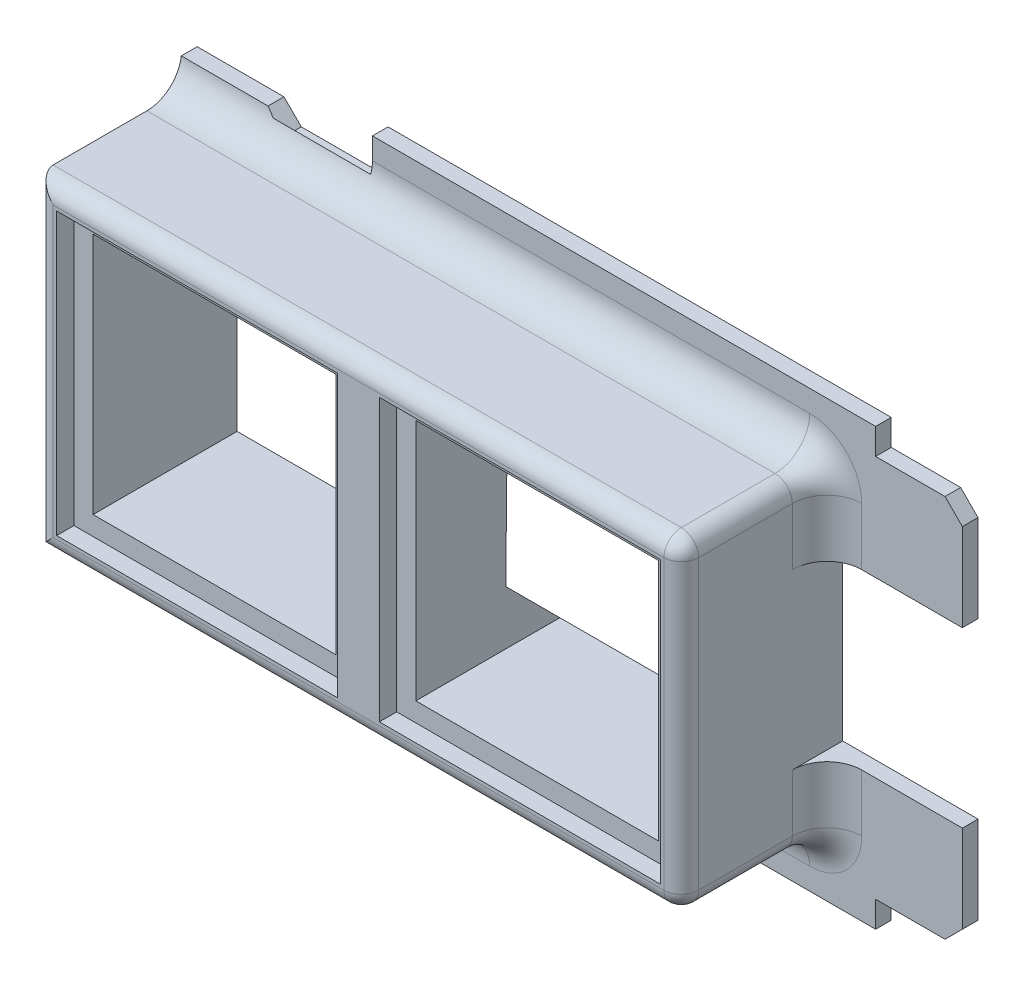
ISO-10303-21;
HEADER;
FILE_DESCRIPTION(('STEP AP214'),'2;1');
FILE_NAME('part.step','',(''),(''),'','','');
FILE_SCHEMA(('AUTOMOTIVE_DESIGN { 1 0 10303 214 1 1 1 1 }'));
ENDSEC;
DATA;
#1=APPLICATION_CONTEXT('core data for automotive mechanical design processes');
#2=APPLICATION_PROTOCOL_DEFINITION('international standard','automotive_design',2000,#1);
#3=PRODUCT_CONTEXT('',#1,'mechanical');
#4=PRODUCT('Part','Part','',(#3));
#5=PRODUCT_RELATED_PRODUCT_CATEGORY('part','',(#4));
#6=PRODUCT_DEFINITION_FORMATION('','',#4);
#7=PRODUCT_DEFINITION_CONTEXT('part definition',#1,'design');
#8=PRODUCT_DEFINITION('design','',#6,#7);
#9=PRODUCT_DEFINITION_SHAPE('','',#8);
#10=(LENGTH_UNIT() NAMED_UNIT(*) SI_UNIT(.MILLI.,.METRE.));
#11=(NAMED_UNIT(*) PLANE_ANGLE_UNIT() SI_UNIT($,.RADIAN.));
#12=(NAMED_UNIT(*) SI_UNIT($,.STERADIAN.) SOLID_ANGLE_UNIT());
#13=UNCERTAINTY_MEASURE_WITH_UNIT(LENGTH_MEASURE(1.E-05),#10,'distance_accuracy_value','');
#14=(GEOMETRIC_REPRESENTATION_CONTEXT(3) GLOBAL_UNCERTAINTY_ASSIGNED_CONTEXT((#13)) GLOBAL_UNIT_ASSIGNED_CONTEXT((#10,
#11,#12)) REPRESENTATION_CONTEXT('',''));
#15=CARTESIAN_POINT('',(0.,0.,0.));
#16=DIRECTION('',(0.,0.,1.));
#17=DIRECTION('',(1.,0.,0.));
#18=AXIS2_PLACEMENT_3D('',#15,#16,#17);
#19=CARTESIAN_POINT('',(-18.6,-9.3,9.3));
#20=DIRECTION('',(0.,1.,0.));
#21=DIRECTION('',(0.,0.,1.));
#22=AXIS2_PLACEMENT_3D('',#19,#20,#21);
#23=PLANE('',#22);
#24=DIRECTION('',(0.,0.,-1.));
#25=VECTOR('',#24,1.);
#26=CARTESIAN_POINT('',(-18.6,-9.3,9.3));
#27=LINE('',#26,#25);
#28=CARTESIAN_POINT('',(-18.6,-9.3,8.3));
#29=VERTEX_POINT('',#28);
#30=CARTESIAN_POINT('',(-18.6,-9.3,2.9));
#31=VERTEX_POINT('',#30);
#32=EDGE_CURVE('E661',#29,#31,#27,.T.);
#33=ORIENTED_EDGE('',*,*,#32,.T.);
#34=DIRECTION('',(-1.,0.,0.));
#35=VECTOR('',#34,1.);
#36=CARTESIAN_POINT('',(17.6,-9.3,2.9));
#37=LINE('',#36,#35);
#38=CARTESIAN_POINT('',(17.6,-9.3,2.9));
#39=VERTEX_POINT('',#38);
#40=EDGE_CURVE('E748',#31,#39,#37,.F.);
#41=ORIENTED_EDGE('',*,*,#40,.T.);
#42=DIRECTION('',(0.,0.,-1.));
#43=VECTOR('',#42,1.);
#44=CARTESIAN_POINT('',(17.6,-9.3,9.3));
#45=LINE('',#44,#43);
#46=CARTESIAN_POINT('',(17.6,-9.3,8.3));
#47=VERTEX_POINT('',#46);
#48=EDGE_CURVE('E681',#39,#47,#45,.F.);
#49=ORIENTED_EDGE('',*,*,#48,.T.);
#50=DIRECTION('',(1.,0.,0.));
#51=VECTOR('',#50,1.);
#52=CARTESIAN_POINT('',(-18.6,-9.3,8.3));
#53=LINE('',#52,#51);
#54=EDGE_CURVE('E679',#47,#29,#53,.F.);
#55=ORIENTED_EDGE('',*,*,#54,.T.);
#56=EDGE_LOOP('',(#33,#41,#49,#55));
#57=FACE_BOUND('',#56,.T.);
#58=ADVANCED_FACE('F39',(#57),#23,.F.);
#59=CARTESIAN_POINT('',(-18.6,9.3,9.3));
#60=DIRECTION('',(0.,-1.,0.));
#61=DIRECTION('',(0.,0.,-1.));
#62=AXIS2_PLACEMENT_3D('',#59,#60,#61);
#63=PLANE('',#62);
#64=DIRECTION('',(0.,0.,-1.));
#65=VECTOR('',#64,1.);
#66=CARTESIAN_POINT('',(17.6,9.3,9.3));
#67=LINE('',#66,#65);
#68=CARTESIAN_POINT('',(17.6,9.3,8.3));
#69=VERTEX_POINT('',#68);
#70=CARTESIAN_POINT('',(17.6,9.3,2.9));
#71=VERTEX_POINT('',#70);
#72=EDGE_CURVE('E696',#69,#71,#67,.T.);
#73=ORIENTED_EDGE('',*,*,#72,.T.);
#74=DIRECTION('',(1.,0.,0.));
#75=VECTOR('',#74,1.);
#76=CARTESIAN_POINT('',(-18.6,9.3,2.9));
#77=LINE('',#76,#75);
#78=CARTESIAN_POINT('',(-18.6,9.3,2.9));
#79=VERTEX_POINT('',#78);
#80=EDGE_CURVE('E746',#71,#79,#77,.F.);
#81=ORIENTED_EDGE('',*,*,#80,.T.);
#82=DIRECTION('',(0.,0.,-1.));
#83=VECTOR('',#82,1.);
#84=CARTESIAN_POINT('',(-18.6,9.3,9.3));
#85=LINE('',#84,#83);
#86=CARTESIAN_POINT('',(-18.6,9.3,8.3));
#87=VERTEX_POINT('',#86);
#88=EDGE_CURVE('E664',#87,#79,#85,.T.);
#89=ORIENTED_EDGE('',*,*,#88,.F.);
#90=DIRECTION('',(-1.,0.,0.));
#91=VECTOR('',#90,1.);
#92=CARTESIAN_POINT('',(-18.6,9.3,8.3));
#93=LINE('',#92,#91);
#94=EDGE_CURVE('E694',#87,#69,#93,.F.);
#95=ORIENTED_EDGE('',*,*,#94,.T.);
#96=EDGE_LOOP('',(#73,#81,#89,#95));
#97=FACE_BOUND('',#96,.T.);
#98=ADVANCED_FACE('F917',(#97),#63,.F.);
#99=CARTESIAN_POINT('',(2.30000000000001,7.,9.3));
#100=DIRECTION('',(1.,0.,0.));
#101=DIRECTION('',(0.,1.,0.));
#102=AXIS2_PLACEMENT_3D('',#99,#100,#101);
#103=PLANE('',#102);
#104=DIRECTION('',(0.,0.707106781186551,-0.707106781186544));
#105=VECTOR('',#104,1.);
#106=CARTESIAN_POINT('',(2.3,7.,0.));
#107=LINE('',#106,#105);
#108=CARTESIAN_POINT('',(2.3,3.96609061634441,3.03390938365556));
#109=VERTEX_POINT('',#108);
#110=CARTESIAN_POINT('',(2.30000000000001,7.,0.));
#111=VERTEX_POINT('',#110);
#112=EDGE_CURVE('E448',#109,#111,#107,.T.);
#113=ORIENTED_EDGE('',*,*,#112,.T.);
#114=DIRECTION('',(0.,0.,-1.));
#115=VECTOR('',#114,1.);
#116=CARTESIAN_POINT('',(2.30000000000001,7.,9.3));
#117=LINE('',#116,#115);
#118=CARTESIAN_POINT('',(2.30000000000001,7.,8.3));
#119=VERTEX_POINT('',#118);
#120=EDGE_CURVE('E627',#119,#111,#117,.T.);
#121=ORIENTED_EDGE('',*,*,#120,.F.);
#122=DIRECTION('',(0.,-1.,0.));
#123=VECTOR('',#122,1.);
#124=CARTESIAN_POINT('',(2.30000000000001,7.,8.3));
#125=LINE('',#124,#123);
#126=CARTESIAN_POINT('',(2.30000000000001,-7.,8.3));
#127=VERTEX_POINT('',#126);
#128=EDGE_CURVE('E609',#119,#127,#125,.T.);
#129=ORIENTED_EDGE('',*,*,#128,.T.);
#130=DIRECTION('',(0.,0.,-1.));
#131=VECTOR('',#130,1.);
#132=CARTESIAN_POINT('',(2.30000000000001,-7.,9.3));
#133=LINE('',#132,#131);
#134=CARTESIAN_POINT('',(2.30000000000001,-7.,0.));
#135=VERTEX_POINT('',#134);
#136=EDGE_CURVE('E634',#127,#135,#133,.T.);
#137=ORIENTED_EDGE('',*,*,#136,.T.);
#138=DIRECTION('',(0.,0.707106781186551,0.707106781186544));
#139=VECTOR('',#138,1.);
#140=CARTESIAN_POINT('',(2.3,-3.883567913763,3.11643208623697));
#141=LINE('',#140,#139);
#142=CARTESIAN_POINT('',(2.3,-3.88356791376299,3.11643208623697));
#143=VERTEX_POINT('',#142);
#144=EDGE_CURVE('E434',#135,#143,#141,.T.);
#145=ORIENTED_EDGE('',*,*,#144,.T.);
#146=DIRECTION('',(0.,0.999944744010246,-0.01051232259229));
#147=VECTOR('',#146,1.);
#148=CARTESIAN_POINT('',(2.3,3.96609061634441,3.03390938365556));
#149=LINE('',#148,#147);
#150=EDGE_CURVE('E452',#143,#109,#149,.T.);
#151=ORIENTED_EDGE('',*,*,#150,.T.);
#152=EDGE_LOOP('',(#113,#121,#129,#137,#145,#151));
#153=FACE_BOUND('',#152,.T.);
#154=ADVANCED_FACE('F922',(#153),#103,.T.);
#155=CARTESIAN_POINT('',(2.30000000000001,-7.,9.3));
#156=DIRECTION('',(0.,1.,0.));
#157=DIRECTION('',(-1.,0.,0.));
#158=AXIS2_PLACEMENT_3D('',#155,#156,#157);
#159=PLANE('',#158);
#160=ORIENTED_EDGE('',*,*,#136,.F.);
#161=DIRECTION('',(1.,0.,0.));
#162=VECTOR('',#161,1.);
#163=CARTESIAN_POINT('',(2.30000000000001,-7.,8.3));
#164=LINE('',#163,#162);
#165=CARTESIAN_POINT('',(16.3,-7.,8.3));
#166=VERTEX_POINT('',#165);
#167=EDGE_CURVE('E606',#127,#166,#164,.T.);
#168=ORIENTED_EDGE('',*,*,#167,.T.);
#169=DIRECTION('',(0.,0.,-1.));
#170=VECTOR('',#169,1.);
#171=CARTESIAN_POINT('',(16.3,-7.,9.3));
#172=LINE('',#171,#170);
#173=CARTESIAN_POINT('',(16.3,-7.,0.));
#174=VERTEX_POINT('',#173);
#175=EDGE_CURVE('E632',#166,#174,#172,.T.);
#176=ORIENTED_EDGE('',*,*,#175,.T.);
#177=DIRECTION('',(1.,0.,0.));
#178=VECTOR('',#177,1.);
#179=CARTESIAN_POINT('',(2.30000000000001,-7.,0.));
#180=LINE('',#179,#178);
#181=EDGE_CURVE('E618',#135,#174,#180,.T.);
#182=ORIENTED_EDGE('',*,*,#181,.F.);
#183=EDGE_LOOP('',(#160,#168,#176,#182));
#184=FACE_BOUND('',#183,.T.);
#185=ADVANCED_FACE('F1269',(#184),#159,.T.);
#186=CARTESIAN_POINT('',(16.3,7.,9.3));
#187=DIRECTION('',(-1.,0.,0.));
#188=DIRECTION('',(0.,0.,1.));
#189=AXIS2_PLACEMENT_3D('',#186,#187,#188);
#190=PLANE('',#189);
#191=ORIENTED_EDGE('',*,*,#175,.F.);
#192=DIRECTION('',(0.,1.,0.));
#193=VECTOR('',#192,1.);
#194=CARTESIAN_POINT('',(16.3,7.,8.3));
#195=LINE('',#194,#193);
#196=CARTESIAN_POINT('',(16.3,7.,8.3));
#197=VERTEX_POINT('',#196);
#198=EDGE_CURVE('E567',#166,#197,#195,.T.);
#199=ORIENTED_EDGE('',*,*,#198,.T.);
#200=DIRECTION('',(0.,0.,-1.));
#201=VECTOR('',#200,1.);
#202=CARTESIAN_POINT('',(16.3,7.,9.3));
#203=LINE('',#202,#201);
#204=CARTESIAN_POINT('',(16.3,7.,0.));
#205=VERTEX_POINT('',#204);
#206=EDGE_CURVE('E630',#197,#205,#203,.T.);
#207=ORIENTED_EDGE('',*,*,#206,.T.);
#208=DIRECTION('',(0.,1.,0.));
#209=VECTOR('',#208,1.);
#210=CARTESIAN_POINT('',(16.3,7.,0.));
#211=LINE('',#210,#209);
#212=EDGE_CURVE('E621',#174,#205,#211,.T.);
#213=ORIENTED_EDGE('',*,*,#212,.F.);
#214=EDGE_LOOP('',(#191,#199,#207,#213));
#215=FACE_BOUND('',#214,.T.);
#216=ADVANCED_FACE('F1261',(#215),#190,.T.);
#217=CARTESIAN_POINT('',(2.30000000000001,7.,9.3));
#218=DIRECTION('',(0.,-1.,0.));
#219=DIRECTION('',(1.,0.,0.));
#220=AXIS2_PLACEMENT_3D('',#217,#218,#219);
#221=PLANE('',#220);
#222=ORIENTED_EDGE('',*,*,#206,.F.);
#223=DIRECTION('',(-1.,0.,0.));
#224=VECTOR('',#223,1.);
#225=CARTESIAN_POINT('',(2.30000000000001,7.,8.3));
#226=LINE('',#225,#224);
#227=EDGE_CURVE('E667',#197,#119,#226,.T.);
#228=ORIENTED_EDGE('',*,*,#227,.T.);
#229=ORIENTED_EDGE('',*,*,#120,.T.);
#230=DIRECTION('',(-1.,0.,0.));
#231=VECTOR('',#230,1.);
#232=CARTESIAN_POINT('',(2.30000000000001,7.,0.));
#233=LINE('',#232,#231);
#234=EDGE_CURVE('E624',#205,#111,#233,.T.);
#235=ORIENTED_EDGE('',*,*,#234,.F.);
#236=EDGE_LOOP('',(#222,#228,#229,#235));
#237=FACE_BOUND('',#236,.T.);
#238=ADVANCED_FACE('F1257',(#237),#221,.T.);
#239=CARTESIAN_POINT('',(0.,0.,9.3));
#240=DIRECTION('',(0.,0.,-1.));
#241=DIRECTION('',(-1.,0.,0.));
#242=AXIS2_PLACEMENT_3D('',#239,#240,#241);
#243=PLANE('',#242);
#244=DIRECTION('',(0.,-1.,0.));
#245=VECTOR('',#244,1.);
#246=CARTESIAN_POINT('',(-17.6,0.,9.3));
#247=LINE('',#246,#245);
#248=CARTESIAN_POINT('',(-17.6,8.3,9.3));
#249=VERTEX_POINT('',#248);
#250=CARTESIAN_POINT('',(-17.6,-8.3,9.3));
#251=VERTEX_POINT('',#250);
#252=EDGE_CURVE('E687',#249,#251,#247,.T.);
#253=ORIENTED_EDGE('',*,*,#252,.T.);
#254=DIRECTION('',(1.,0.,0.));
#255=VECTOR('',#254,1.);
#256=CARTESIAN_POINT('',(0.,-8.3,9.3));
#257=LINE('',#256,#255);
#258=CARTESIAN_POINT('',(17.6,-8.3,9.3));
#259=VERTEX_POINT('',#258);
#260=EDGE_CURVE('E689',#251,#259,#257,.T.);
#261=ORIENTED_EDGE('',*,*,#260,.T.);
#262=DIRECTION('',(0.,1.,0.));
#263=VECTOR('',#262,1.);
#264=CARTESIAN_POINT('',(17.6,0.,9.3));
#265=LINE('',#264,#263);
#266=CARTESIAN_POINT('',(17.6,8.3,9.3));
#267=VERTEX_POINT('',#266);
#268=EDGE_CURVE('E685',#259,#267,#265,.T.);
#269=ORIENTED_EDGE('',*,*,#268,.T.);
#270=DIRECTION('',(-1.,0.,0.));
#271=VECTOR('',#270,1.);
#272=CARTESIAN_POINT('',(0.,8.3,9.3));
#273=LINE('',#272,#271);
#274=EDGE_CURVE('E683',#267,#249,#273,.T.);
#275=ORIENTED_EDGE('',*,*,#274,.T.);
#276=EDGE_LOOP('',(#253,#261,#269,#275));
#277=FACE_BOUND('',#276,.T.);
#278=DIRECTION('',(1.,0.,0.));
#279=VECTOR('',#278,1.);
#280=CARTESIAN_POINT('',(-17.4,-8.1,9.3));
#281=LINE('',#280,#279);
#282=CARTESIAN_POINT('',(-17.4,-8.1,9.3));
#283=VERTEX_POINT('',#282);
#284=CARTESIAN_POINT('',(-1.2,-8.1,9.3));
#285=VERTEX_POINT('',#284);
#286=EDGE_CURVE('E556',#283,#285,#281,.T.);
#287=ORIENTED_EDGE('',*,*,#286,.F.);
#288=DIRECTION('',(0.,-1.,0.));
#289=VECTOR('',#288,1.);
#290=CARTESIAN_POINT('',(-17.4,-8.1,9.3));
#291=LINE('',#290,#289);
#292=CARTESIAN_POINT('',(-17.4,8.1,9.3));
#293=VERTEX_POINT('',#292);
#294=EDGE_CURVE('E554',#293,#283,#291,.T.);
#295=ORIENTED_EDGE('',*,*,#294,.F.);
#296=DIRECTION('',(-1.,0.,0.));
#297=VECTOR('',#296,1.);
#298=CARTESIAN_POINT('',(-17.4,8.1,9.3));
#299=LINE('',#298,#297);
#300=CARTESIAN_POINT('',(-1.2,8.1,9.3));
#301=VERTEX_POINT('',#300);
#302=EDGE_CURVE('E544',#301,#293,#299,.T.);
#303=ORIENTED_EDGE('',*,*,#302,.F.);
#304=DIRECTION('',(0.,1.,0.));
#305=VECTOR('',#304,1.);
#306=CARTESIAN_POINT('',(-1.2,-8.1,9.3));
#307=LINE('',#306,#305);
#308=EDGE_CURVE('E560',#285,#301,#307,.T.);
#309=ORIENTED_EDGE('',*,*,#308,.F.);
#310=EDGE_LOOP('',(#287,#295,#303,#309));
#311=FACE_BOUND('',#310,.T.);
#312=DIRECTION('',(1.,0.,0.));
#313=VECTOR('',#312,1.);
#314=CARTESIAN_POINT('',(1.20000000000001,-8.1,9.3));
#315=LINE('',#314,#313);
#316=CARTESIAN_POINT('',(1.20000000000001,-8.1,9.3));
#317=VERTEX_POINT('',#316);
#318=CARTESIAN_POINT('',(17.4,-8.1,9.3));
#319=VERTEX_POINT('',#318);
#320=EDGE_CURVE('E589',#317,#319,#315,.T.);
#321=ORIENTED_EDGE('',*,*,#320,.F.);
#322=DIRECTION('',(0.,-1.,0.));
#323=VECTOR('',#322,1.);
#324=CARTESIAN_POINT('',(1.20000000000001,8.1,9.3));
#325=LINE('',#324,#323);
#326=CARTESIAN_POINT('',(1.20000000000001,8.1,9.3));
#327=VERTEX_POINT('',#326);
#328=EDGE_CURVE('E537',#327,#317,#325,.T.);
#329=ORIENTED_EDGE('',*,*,#328,.F.);
#330=DIRECTION('',(-1.,0.,0.));
#331=VECTOR('',#330,1.);
#332=CARTESIAN_POINT('',(1.20000000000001,8.1,9.3));
#333=LINE('',#332,#331);
#334=CARTESIAN_POINT('',(17.4,8.1,9.3));
#335=VERTEX_POINT('',#334);
#336=EDGE_CURVE('E578',#335,#327,#333,.T.);
#337=ORIENTED_EDGE('',*,*,#336,.F.);
#338=DIRECTION('',(0.,1.,0.));
#339=VECTOR('',#338,1.);
#340=CARTESIAN_POINT('',(17.4,8.1,9.3));
#341=LINE('',#340,#339);
#342=EDGE_CURVE('E592',#319,#335,#341,.T.);
#343=ORIENTED_EDGE('',*,*,#342,.F.);
#344=EDGE_LOOP('',(#321,#329,#337,#343));
#345=FACE_BOUND('',#344,.T.);
#346=ADVANCED_FACE('F1156',(#277,#311,#345),#243,.F.);
#347=CARTESIAN_POINT('',(0.,0.,0.));
#348=DIRECTION('',(0.,0.,-1.));
#349=DIRECTION('',(-1.,0.,0.));
#350=AXIS2_PLACEMENT_3D('',#347,#348,#349);
#351=PLANE('',#350);
#352=DIRECTION('',(0.,-1.,0.));
#353=VECTOR('',#352,1.);
#354=CARTESIAN_POINT('',(26.4,0.,0.));
#355=LINE('',#354,#353);
#356=CARTESIAN_POINT('',(26.4,-5.,0.));
#357=VERTEX_POINT('',#356);
#358=CARTESIAN_POINT('',(26.4,-10.05,0.));
#359=VERTEX_POINT('',#358);
#360=EDGE_CURVE('E511',#357,#359,#355,.T.);
#361=ORIENTED_EDGE('',*,*,#360,.T.);
#362=DIRECTION('',(-0.707106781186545,-0.70710678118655,0.));
#363=VECTOR('',#362,1.);
#364=CARTESIAN_POINT('',(18.2250000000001,-18.225,0.));
#365=LINE('',#364,#363);
#366=CARTESIAN_POINT('',(25.4,-11.05,0.));
#367=VERTEX_POINT('',#366);
#368=EDGE_CURVE('E803',#359,#367,#365,.T.);
#369=ORIENTED_EDGE('',*,*,#368,.T.);
#370=DIRECTION('',(-1.,0.,0.));
#371=VECTOR('',#370,1.);
#372=CARTESIAN_POINT('',(26.4,-11.05,0.));
#373=LINE('',#372,#371);
#374=CARTESIAN_POINT('',(21.4,-11.05,0.));
#375=VERTEX_POINT('',#374);
#376=EDGE_CURVE('E468',#367,#375,#373,.T.);
#377=ORIENTED_EDGE('',*,*,#376,.T.);
#378=DIRECTION('',(0.,-1.,0.));
#379=VECTOR('',#378,1.);
#380=CARTESIAN_POINT('',(21.4,-12.55,0.));
#381=LINE('',#380,#379);
#382=CARTESIAN_POINT('',(21.4,-12.55,0.));
#383=VERTEX_POINT('',#382);
#384=EDGE_CURVE('E470',#375,#383,#381,.T.);
#385=ORIENTED_EDGE('',*,*,#384,.T.);
#386=DIRECTION('',(1.,0.,0.));
#387=VECTOR('',#386,1.);
#388=CARTESIAN_POINT('',(0.,-12.55,0.));
#389=LINE('',#388,#387);
#390=CARTESIAN_POINT('',(-7.6,-12.55,0.));
#391=VERTEX_POINT('',#390);
#392=EDGE_CURVE('E502',#391,#383,#389,.T.);
#393=ORIENTED_EDGE('',*,*,#392,.F.);
#394=DIRECTION('',(0.,-1.,0.));
#395=VECTOR('',#394,1.);
#396=CARTESIAN_POINT('',(-7.6,-12.55,0.));
#397=LINE('',#396,#395);
#398=CARTESIAN_POINT('',(-7.6,-10.05,0.));
#399=VERTEX_POINT('',#398);
#400=EDGE_CURVE('E394',#399,#391,#397,.T.);
#401=ORIENTED_EDGE('',*,*,#400,.F.);
#402=DIRECTION('',(1.,0.,0.));
#403=VECTOR('',#402,1.);
#404=CARTESIAN_POINT('',(-13.6,-10.05,0.));
#405=LINE('',#404,#403);
#406=CARTESIAN_POINT('',(-12.6,-10.05,0.));
#407=VERTEX_POINT('',#406);
#408=EDGE_CURVE('E400',#407,#399,#405,.T.);
#409=ORIENTED_EDGE('',*,*,#408,.F.);
#410=DIRECTION('',(0.707106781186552,0.707106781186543,0.));
#411=VECTOR('',#410,1.);
#412=CARTESIAN_POINT('',(-12.6,-10.05,0.));
#413=LINE('',#412,#411);
#414=CARTESIAN_POINT('',(-13.6,-11.05,0.));
#415=VERTEX_POINT('',#414);
#416=EDGE_CURVE('E817',#407,#415,#413,.F.);
#417=ORIENTED_EDGE('',*,*,#416,.T.);
#418=DIRECTION('',(-1.,0.,0.));
#419=VECTOR('',#418,1.);
#420=CARTESIAN_POINT('',(-18.6,-11.05,0.));
#421=LINE('',#420,#419);
#422=CARTESIAN_POINT('',(-18.6,-11.05,0.));
#423=VERTEX_POINT('',#422);
#424=EDGE_CURVE('E441',#415,#423,#421,.T.);
#425=ORIENTED_EDGE('',*,*,#424,.T.);
#426=DIRECTION('',(0.,-1.,0.));
#427=VECTOR('',#426,1.);
#428=CARTESIAN_POINT('',(-18.6,-9.3,0.));
#429=LINE('',#428,#427);
#430=CARTESIAN_POINT('',(-18.6,11.05,0.));
#431=VERTEX_POINT('',#430);
#432=EDGE_CURVE('E658',#431,#423,#429,.T.);
#433=ORIENTED_EDGE('',*,*,#432,.F.);
#434=DIRECTION('',(1.,0.,0.));
#435=VECTOR('',#434,1.);
#436=CARTESIAN_POINT('',(-18.6,11.05,0.));
#437=LINE('',#436,#435);
#438=CARTESIAN_POINT('',(-13.6,11.05,0.));
#439=VERTEX_POINT('',#438);
#440=EDGE_CURVE('E466',#431,#439,#437,.T.);
#441=ORIENTED_EDGE('',*,*,#440,.T.);
#442=DIRECTION('',(-0.707106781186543,0.707106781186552,0.));
#443=VECTOR('',#442,1.);
#444=CARTESIAN_POINT('',(-13.6,11.05,0.));
#445=LINE('',#444,#443);
#446=CARTESIAN_POINT('',(-12.6,10.05,0.));
#447=VERTEX_POINT('',#446);
#448=EDGE_CURVE('E48',#439,#447,#445,.F.);
#449=ORIENTED_EDGE('',*,*,#448,.T.);
#450=DIRECTION('',(-1.,0.,0.));
#451=VECTOR('',#450,1.);
#452=CARTESIAN_POINT('',(-13.6,10.05,0.));
#453=LINE('',#452,#451);
#454=CARTESIAN_POINT('',(-7.6,10.05,0.));
#455=VERTEX_POINT('',#454);
#456=EDGE_CURVE('E419',#455,#447,#453,.T.);
#457=ORIENTED_EDGE('',*,*,#456,.F.);
#458=DIRECTION('',(0.,-1.,0.));
#459=VECTOR('',#458,1.);
#460=CARTESIAN_POINT('',(-7.6,12.55,0.));
#461=LINE('',#460,#459);
#462=CARTESIAN_POINT('',(-7.6,12.55,0.));
#463=VERTEX_POINT('',#462);
#464=EDGE_CURVE('E422',#463,#455,#461,.T.);
#465=ORIENTED_EDGE('',*,*,#464,.F.);
#466=DIRECTION('',(1.,0.,0.));
#467=VECTOR('',#466,1.);
#468=CARTESIAN_POINT('',(0.,12.55,0.));
#469=LINE('',#468,#467);
#470=CARTESIAN_POINT('',(21.4,12.55,0.));
#471=VERTEX_POINT('',#470);
#472=EDGE_CURVE('E518',#463,#471,#469,.T.);
#473=ORIENTED_EDGE('',*,*,#472,.T.);
#474=DIRECTION('',(0.,-1.,0.));
#475=VECTOR('',#474,1.);
#476=CARTESIAN_POINT('',(21.4,12.55,0.));
#477=LINE('',#476,#475);
#478=CARTESIAN_POINT('',(21.4,11.05,0.));
#479=VERTEX_POINT('',#478);
#480=EDGE_CURVE('E478',#471,#479,#477,.T.);
#481=ORIENTED_EDGE('',*,*,#480,.T.);
#482=DIRECTION('',(1.,0.,0.));
#483=VECTOR('',#482,1.);
#484=CARTESIAN_POINT('',(26.4,11.05,0.));
#485=LINE('',#484,#483);
#486=CARTESIAN_POINT('',(25.4,11.05,0.));
#487=VERTEX_POINT('',#486);
#488=EDGE_CURVE('E489',#479,#487,#485,.T.);
#489=ORIENTED_EDGE('',*,*,#488,.T.);
#490=DIRECTION('',(0.70710678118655,-0.707106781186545,0.));
#491=VECTOR('',#490,1.);
#492=CARTESIAN_POINT('',(18.2249999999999,18.225,0.));
#493=LINE('',#492,#491);
#494=CARTESIAN_POINT('',(26.4,10.05,0.));
#495=VERTEX_POINT('',#494);
#496=EDGE_CURVE('E801',#487,#495,#493,.T.);
#497=ORIENTED_EDGE('',*,*,#496,.T.);
#498=DIRECTION('',(0.,-1.,0.));
#499=VECTOR('',#498,1.);
#500=CARTESIAN_POINT('',(26.4,0.,0.));
#501=LINE('',#500,#499);
#502=CARTESIAN_POINT('',(26.4,5.,0.));
#503=VERTEX_POINT('',#502);
#504=EDGE_CURVE('E530',#495,#503,#501,.T.);
#505=ORIENTED_EDGE('',*,*,#504,.T.);
#506=DIRECTION('',(-1.,0.,0.));
#507=VECTOR('',#506,1.);
#508=CARTESIAN_POINT('',(0.,4.99999999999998,0.));
#509=LINE('',#508,#507);
#510=CARTESIAN_POINT('',(18.6,5.,0.));
#511=VERTEX_POINT('',#510);
#512=EDGE_CURVE('E523',#503,#511,#509,.T.);
#513=ORIENTED_EDGE('',*,*,#512,.T.);
#514=DIRECTION('',(0.,1.,0.));
#515=VECTOR('',#514,1.);
#516=CARTESIAN_POINT('',(18.6,-9.3,0.));
#517=LINE('',#516,#515);
#518=CARTESIAN_POINT('',(18.6,-5.,0.));
#519=VERTEX_POINT('',#518);
#520=EDGE_CURVE('E656',#519,#511,#517,.T.);
#521=ORIENTED_EDGE('',*,*,#520,.F.);
#522=DIRECTION('',(1.,0.,0.));
#523=VECTOR('',#522,1.);
#524=CARTESIAN_POINT('',(0.,-5.,0.));
#525=LINE('',#524,#523);
#526=EDGE_CURVE('E508',#519,#357,#525,.T.);
#527=ORIENTED_EDGE('',*,*,#526,.T.);
#528=EDGE_LOOP('',(#361,#369,#377,#385,#393,#401,#409,#417,#425,#433,#441,#449,#457,#465,#473,
#481,#489,#497,#505,#513,#521,#527));
#529=FACE_BOUND('',#528,.T.);
#530=DIRECTION('',(-1.,0.,0.));
#531=VECTOR('',#530,1.);
#532=CARTESIAN_POINT('',(26.401,7.,0.));
#533=LINE('',#532,#531);
#534=CARTESIAN_POINT('',(-2.29999999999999,7.,0.));
#535=VERTEX_POINT('',#534);
#536=EDGE_CURVE('E451',#111,#535,#533,.T.);
#537=ORIENTED_EDGE('',*,*,#536,.T.);
#538=DIRECTION('',(-1.,0.,0.));
#539=VECTOR('',#538,1.);
#540=CARTESIAN_POINT('',(-16.3,7.,0.));
#541=LINE('',#540,#539);
#542=CARTESIAN_POINT('',(-16.3,7.,0.));
#543=VERTEX_POINT('',#542);
#544=EDGE_CURVE('E643',#535,#543,#541,.T.);
#545=ORIENTED_EDGE('',*,*,#544,.T.);
#546=DIRECTION('',(0.,-1.,0.));
#547=VECTOR('',#546,1.);
#548=CARTESIAN_POINT('',(-16.3,-7.,0.));
#549=LINE('',#548,#547);
#550=CARTESIAN_POINT('',(-16.3,-7.,0.));
#551=VERTEX_POINT('',#550);
#552=EDGE_CURVE('E637',#543,#551,#549,.T.);
#553=ORIENTED_EDGE('',*,*,#552,.T.);
#554=DIRECTION('',(1.,0.,0.));
#555=VECTOR('',#554,1.);
#556=CARTESIAN_POINT('',(-16.3,-7.,0.));
#557=LINE('',#556,#555);
#558=CARTESIAN_POINT('',(-2.29999999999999,-7.,0.));
#559=VERTEX_POINT('',#558);
#560=EDGE_CURVE('E640',#551,#559,#557,.T.);
#561=ORIENTED_EDGE('',*,*,#560,.T.);
#562=DIRECTION('',(-1.,0.,0.));
#563=VECTOR('',#562,1.);
#564=CARTESIAN_POINT('',(26.401,-7.,0.));
#565=LINE('',#564,#563);
#566=EDGE_CURVE('E433',#135,#559,#565,.T.);
#567=ORIENTED_EDGE('',*,*,#566,.F.);
#568=ORIENTED_EDGE('',*,*,#181,.T.);
#569=ORIENTED_EDGE('',*,*,#212,.T.);
#570=ORIENTED_EDGE('',*,*,#234,.T.);
#571=EDGE_LOOP('',(#537,#545,#553,#561,#567,#568,#569,#570));
#572=FACE_BOUND('',#571,.T.);
#573=ADVANCED_FACE('F822',(#529,#572),#351,.T.);
#574=CARTESIAN_POINT('',(18.6,-9.3,9.3));
#575=DIRECTION('',(-1.,0.,0.));
#576=DIRECTION('',(0.,0.,1.));
#577=AXIS2_PLACEMENT_3D('',#574,#575,#576);
#578=PLANE('',#577);
#579=DIRECTION('',(0.,0.,-1.));
#580=VECTOR('',#579,1.);
#581=CARTESIAN_POINT('',(18.6,5.,0.9));
#582=LINE('',#581,#580);
#583=CARTESIAN_POINT('',(18.6,5.,2.9));
#584=VERTEX_POINT('',#583);
#585=EDGE_CURVE('E534',#584,#511,#582,.T.);
#586=ORIENTED_EDGE('',*,*,#585,.F.);
#587=DIRECTION('',(0.,-1.,0.));
#588=VECTOR('',#587,1.);
#589=CARTESIAN_POINT('',(18.6,8.3,2.9));
#590=LINE('',#589,#588);
#591=CARTESIAN_POINT('',(18.6,8.3,2.9));
#592=VERTEX_POINT('',#591);
#593=EDGE_CURVE('E732',#584,#592,#590,.F.);
#594=ORIENTED_EDGE('',*,*,#593,.T.);
#595=DIRECTION('',(0.,0.,-1.));
#596=VECTOR('',#595,1.);
#597=CARTESIAN_POINT('',(18.6,8.3,9.3));
#598=LINE('',#597,#596);
#599=CARTESIAN_POINT('',(18.6,8.3,8.3));
#600=VERTEX_POINT('',#599);
#601=EDGE_CURVE('E672',#592,#600,#598,.F.);
#602=ORIENTED_EDGE('',*,*,#601,.T.);
#603=DIRECTION('',(0.,1.,0.));
#604=VECTOR('',#603,1.);
#605=CARTESIAN_POINT('',(18.6,-9.3,8.3));
#606=LINE('',#605,#604);
#607=CARTESIAN_POINT('',(18.6,-8.3,8.3));
#608=VERTEX_POINT('',#607);
#609=EDGE_CURVE('E674',#600,#608,#606,.F.);
#610=ORIENTED_EDGE('',*,*,#609,.T.);
#611=DIRECTION('',(0.,0.,-1.));
#612=VECTOR('',#611,1.);
#613=CARTESIAN_POINT('',(18.6,-8.3,9.3));
#614=LINE('',#613,#612);
#615=CARTESIAN_POINT('',(18.6,-8.3,2.9));
#616=VERTEX_POINT('',#615);
#617=EDGE_CURVE('E676',#608,#616,#614,.T.);
#618=ORIENTED_EDGE('',*,*,#617,.T.);
#619=DIRECTION('',(0.,-1.,0.));
#620=VECTOR('',#619,1.);
#621=CARTESIAN_POINT('',(18.6,-5.,2.9));
#622=LINE('',#621,#620);
#623=CARTESIAN_POINT('',(18.6,-5.,2.9));
#624=VERTEX_POINT('',#623);
#625=EDGE_CURVE('E729',#616,#624,#622,.F.);
#626=ORIENTED_EDGE('',*,*,#625,.T.);
#627=DIRECTION('',(0.,0.,-1.));
#628=VECTOR('',#627,1.);
#629=CARTESIAN_POINT('',(18.6,-5.,0.9));
#630=LINE('',#629,#628);
#631=EDGE_CURVE('E507',#624,#519,#630,.T.);
#632=ORIENTED_EDGE('',*,*,#631,.T.);
#633=ORIENTED_EDGE('',*,*,#520,.T.);
#634=EDGE_LOOP('',(#586,#594,#602,#610,#618,#626,#632,#633));
#635=FACE_BOUND('',#634,.T.);
#636=ADVANCED_FACE('F868',(#635),#578,.F.);
#637=CARTESIAN_POINT('',(-18.6,-9.3,9.3));
#638=DIRECTION('',(1.,0.,0.));
#639=DIRECTION('',(0.,0.,-1.));
#640=AXIS2_PLACEMENT_3D('',#637,#638,#639);
#641=PLANE('',#640);
#642=CARTESIAN_POINT('',(-18.6,11.3,2.9));
#643=DIRECTION('',(1.,0.,0.));
#644=DIRECTION('',(0.,0.,-1.));
#645=AXIS2_PLACEMENT_3D('',#642,#643,#644);
#646=CIRCLE('',#645,2.);
#647=CARTESIAN_POINT('',(-18.6,11.05,0.915686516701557));
#648=VERTEX_POINT('',#647);
#649=EDGE_CURVE('E755',#79,#648,#646,.T.);
#650=ORIENTED_EDGE('',*,*,#649,.T.);
#651=DIRECTION('',(0.,0.,1.));
#652=VECTOR('',#651,1.);
#653=CARTESIAN_POINT('',(-18.6,11.05,0.));
#654=LINE('',#653,#652);
#655=EDGE_CURVE('E483',#431,#648,#654,.T.);
#656=ORIENTED_EDGE('',*,*,#655,.F.);
#657=ORIENTED_EDGE('',*,*,#432,.T.);
#658=DIRECTION('',(0.,0.,1.));
#659=VECTOR('',#658,1.);
#660=CARTESIAN_POINT('',(-18.6,-11.05,0.));
#661=LINE('',#660,#659);
#662=CARTESIAN_POINT('',(-18.6,-11.05,0.915686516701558));
#663=VERTEX_POINT('',#662);
#664=EDGE_CURVE('E463',#423,#663,#661,.T.);
#665=ORIENTED_EDGE('',*,*,#664,.T.);
#666=CARTESIAN_POINT('',(-18.6,-11.3,2.9));
#667=DIRECTION('',(1.,0.,0.));
#668=DIRECTION('',(0.,0.,-1.));
#669=AXIS2_PLACEMENT_3D('',#666,#667,#668);
#670=CIRCLE('',#669,2.);
#671=EDGE_CURVE('E758',#663,#31,#670,.T.);
#672=ORIENTED_EDGE('',*,*,#671,.T.);
#673=ORIENTED_EDGE('',*,*,#32,.F.);
#674=DIRECTION('',(0.,-1.,0.));
#675=VECTOR('',#674,1.);
#676=CARTESIAN_POINT('',(-18.6,-9.3,8.3));
#677=LINE('',#676,#675);
#678=EDGE_CURVE('E692',#29,#87,#677,.F.);
#679=ORIENTED_EDGE('',*,*,#678,.T.);
#680=ORIENTED_EDGE('',*,*,#88,.T.);
#681=EDGE_LOOP('',(#650,#656,#657,#665,#672,#673,#679,#680));
#682=FACE_BOUND('',#681,.T.);
#683=ADVANCED_FACE('F839',(#682),#641,.F.);
#684=CARTESIAN_POINT('',(-16.3,-7.,9.3));
#685=DIRECTION('',(1.,0.,0.));
#686=DIRECTION('',(0.,0.,-1.));
#687=AXIS2_PLACEMENT_3D('',#684,#685,#686);
#688=PLANE('',#687);
#689=DIRECTION('',(0.,1.,0.));
#690=VECTOR('',#689,1.);
#691=CARTESIAN_POINT('',(-16.3,-7.,8.3));
#692=LINE('',#691,#690);
#693=CARTESIAN_POINT('',(-16.3,-7.,8.3));
#694=VERTEX_POINT('',#693);
#695=CARTESIAN_POINT('',(-16.3,7.,8.3));
#696=VERTEX_POINT('',#695);
#697=EDGE_CURVE('E616',#694,#696,#692,.T.);
#698=ORIENTED_EDGE('',*,*,#697,.F.);
#699=DIRECTION('',(0.,0.,-1.));
#700=VECTOR('',#699,1.);
#701=CARTESIAN_POINT('',(-16.3,-7.,9.3));
#702=LINE('',#701,#700);
#703=EDGE_CURVE('E654',#694,#551,#702,.T.);
#704=ORIENTED_EDGE('',*,*,#703,.T.);
#705=ORIENTED_EDGE('',*,*,#552,.F.);
#706=DIRECTION('',(0.,0.,-1.));
#707=VECTOR('',#706,1.);
#708=CARTESIAN_POINT('',(-16.3,7.,9.3));
#709=LINE('',#708,#707);
#710=EDGE_CURVE('E646',#696,#543,#709,.T.);
#711=ORIENTED_EDGE('',*,*,#710,.F.);
#712=EDGE_LOOP('',(#698,#704,#705,#711));
#713=FACE_BOUND('',#712,.T.);
#714=ADVANCED_FACE('F929',(#713),#688,.T.);
#715=CARTESIAN_POINT('',(-16.3,-7.,9.3));
#716=DIRECTION('',(0.,1.,0.));
#717=DIRECTION('',(0.,0.,1.));
#718=AXIS2_PLACEMENT_3D('',#715,#716,#717);
#719=PLANE('',#718);
#720=DIRECTION('',(-1.,0.,0.));
#721=VECTOR('',#720,1.);
#722=CARTESIAN_POINT('',(-16.3,-7.,8.3));
#723=LINE('',#722,#721);
#724=CARTESIAN_POINT('',(-2.29999999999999,-7.,8.3));
#725=VERTEX_POINT('',#724);
#726=EDGE_CURVE('E614',#725,#694,#723,.T.);
#727=ORIENTED_EDGE('',*,*,#726,.F.);
#728=DIRECTION('',(0.,0.,-1.));
#729=VECTOR('',#728,1.);
#730=CARTESIAN_POINT('',(-2.29999999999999,-7.,9.3));
#731=LINE('',#730,#729);
#732=EDGE_CURVE('E651',#725,#559,#731,.T.);
#733=ORIENTED_EDGE('',*,*,#732,.T.);
#734=ORIENTED_EDGE('',*,*,#560,.F.);
#735=ORIENTED_EDGE('',*,*,#703,.F.);
#736=EDGE_LOOP('',(#727,#733,#734,#735));
#737=FACE_BOUND('',#736,.T.);
#738=ADVANCED_FACE('F1240',(#737),#719,.T.);
#739=CARTESIAN_POINT('',(-2.29999999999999,-7.,9.3));
#740=DIRECTION('',(-1.,0.,0.));
#741=DIRECTION('',(0.,0.,1.));
#742=AXIS2_PLACEMENT_3D('',#739,#740,#741);
#743=PLANE('',#742);
#744=DIRECTION('',(0.,0.707106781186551,-0.707106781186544));
#745=VECTOR('',#744,1.);
#746=CARTESIAN_POINT('',(-2.29999999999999,7.,0.));
#747=LINE('',#746,#745);
#748=CARTESIAN_POINT('',(-2.29999999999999,3.96609061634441,3.03390938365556));
#749=VERTEX_POINT('',#748);
#750=EDGE_CURVE('E439',#749,#535,#747,.T.);
#751=ORIENTED_EDGE('',*,*,#750,.F.);
#752=DIRECTION('',(0.,0.999944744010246,-0.01051232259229));
#753=VECTOR('',#752,1.);
#754=CARTESIAN_POINT('',(-2.29999999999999,3.96609061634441,3.03390938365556));
#755=LINE('',#754,#753);
#756=CARTESIAN_POINT('',(-2.29999999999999,-3.88356791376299,3.11643208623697));
#757=VERTEX_POINT('',#756);
#758=EDGE_CURVE('E442',#757,#749,#755,.T.);
#759=ORIENTED_EDGE('',*,*,#758,.F.);
#760=DIRECTION('',(0.,0.707106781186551,0.707106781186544));
#761=VECTOR('',#760,1.);
#762=CARTESIAN_POINT('',(-2.29999999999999,-3.88356791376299,3.11643208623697));
#763=LINE('',#762,#761);
#764=EDGE_CURVE('E445',#559,#757,#763,.T.);
#765=ORIENTED_EDGE('',*,*,#764,.F.);
#766=ORIENTED_EDGE('',*,*,#732,.F.);
#767=DIRECTION('',(0.,-1.,0.));
#768=VECTOR('',#767,1.);
#769=CARTESIAN_POINT('',(-2.29999999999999,-7.,8.3));
#770=LINE('',#769,#768);
#771=CARTESIAN_POINT('',(-2.29999999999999,7.,8.3));
#772=VERTEX_POINT('',#771);
#773=EDGE_CURVE('E612',#772,#725,#770,.T.);
#774=ORIENTED_EDGE('',*,*,#773,.F.);
#775=DIRECTION('',(0.,0.,-1.));
#776=VECTOR('',#775,1.);
#777=CARTESIAN_POINT('',(-2.29999999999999,7.,9.3));
#778=LINE('',#777,#776);
#779=EDGE_CURVE('E648',#772,#535,#778,.T.);
#780=ORIENTED_EDGE('',*,*,#779,.T.);
#781=EDGE_LOOP('',(#751,#759,#765,#766,#774,#780));
#782=FACE_BOUND('',#781,.T.);
#783=ADVANCED_FACE('F1228',(#782),#743,.T.);
#784=CARTESIAN_POINT('',(-16.3,7.,9.3));
#785=DIRECTION('',(0.,-1.,0.));
#786=DIRECTION('',(0.,0.,-1.));
#787=AXIS2_PLACEMENT_3D('',#784,#785,#786);
#788=PLANE('',#787);
#789=DIRECTION('',(1.,0.,0.));
#790=VECTOR('',#789,1.);
#791=CARTESIAN_POINT('',(-16.3,7.,8.3));
#792=LINE('',#791,#790);
#793=EDGE_CURVE('E670',#696,#772,#792,.T.);
#794=ORIENTED_EDGE('',*,*,#793,.F.);
#795=ORIENTED_EDGE('',*,*,#710,.T.);
#796=ORIENTED_EDGE('',*,*,#544,.F.);
#797=ORIENTED_EDGE('',*,*,#779,.F.);
#798=EDGE_LOOP('',(#794,#795,#796,#797));
#799=FACE_BOUND('',#798,.T.);
#800=ADVANCED_FACE('F1222',(#799),#788,.T.);
#801=CARTESIAN_POINT('',(1.20000000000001,8.1,8.3));
#802=DIRECTION('',(-1.,0.,0.));
#803=DIRECTION('',(0.,-1.,0.));
#804=AXIS2_PLACEMENT_3D('',#801,#802,#803);
#805=PLANE('',#804);
#806=ORIENTED_EDGE('',*,*,#328,.T.);
#807=DIRECTION('',(0.,0.,1.));
#808=VECTOR('',#807,1.);
#809=CARTESIAN_POINT('',(1.20000000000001,-8.1,8.3));
#810=LINE('',#809,#808);
#811=CARTESIAN_POINT('',(1.20000000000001,-8.1,8.3));
#812=VERTEX_POINT('',#811);
#813=EDGE_CURVE('E587',#812,#317,#810,.T.);
#814=ORIENTED_EDGE('',*,*,#813,.F.);
#815=DIRECTION('',(0.,-1.,0.));
#816=VECTOR('',#815,1.);
#817=CARTESIAN_POINT('',(1.20000000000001,8.1,8.3));
#818=LINE('',#817,#816);
#819=CARTESIAN_POINT('',(1.20000000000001,8.1,8.3));
#820=VERTEX_POINT('',#819);
#821=EDGE_CURVE('E574',#820,#812,#818,.T.);
#822=ORIENTED_EDGE('',*,*,#821,.F.);
#823=DIRECTION('',(0.,0.,1.));
#824=VECTOR('',#823,1.);
#825=CARTESIAN_POINT('',(1.20000000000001,8.1,8.3));
#826=LINE('',#825,#824);
#827=EDGE_CURVE('E557',#820,#327,#826,.T.);
#828=ORIENTED_EDGE('',*,*,#827,.T.);
#829=EDGE_LOOP('',(#806,#814,#822,#828));
#830=FACE_BOUND('',#829,.T.);
#831=ADVANCED_FACE('F1227',(#830),#805,.F.);
#832=CARTESIAN_POINT('',(1.20000000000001,8.1,8.3));
#833=DIRECTION('',(0.,1.,0.));
#834=DIRECTION('',(0.,0.,1.));
#835=AXIS2_PLACEMENT_3D('',#832,#833,#834);
#836=PLANE('',#835);
#837=ORIENTED_EDGE('',*,*,#336,.T.);
#838=ORIENTED_EDGE('',*,*,#827,.F.);
#839=DIRECTION('',(-1.,0.,0.));
#840=VECTOR('',#839,1.);
#841=CARTESIAN_POINT('',(1.20000000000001,8.1,8.3));
#842=LINE('',#841,#840);
#843=CARTESIAN_POINT('',(17.4,8.1,8.3));
#844=VERTEX_POINT('',#843);
#845=EDGE_CURVE('E584',#844,#820,#842,.T.);
#846=ORIENTED_EDGE('',*,*,#845,.F.);
#847=DIRECTION('',(0.,0.,1.));
#848=VECTOR('',#847,1.);
#849=CARTESIAN_POINT('',(17.4,8.1,8.3));
#850=LINE('',#849,#848);
#851=EDGE_CURVE('E598',#844,#335,#850,.T.);
#852=ORIENTED_EDGE('',*,*,#851,.T.);
#853=EDGE_LOOP('',(#837,#838,#846,#852));
#854=FACE_BOUND('',#853,.T.);
#855=ADVANCED_FACE('F1488',(#854),#836,.F.);
#856=CARTESIAN_POINT('',(17.4,8.1,8.3));
#857=DIRECTION('',(1.,0.,0.));
#858=DIRECTION('',(0.,1.,0.));
#859=AXIS2_PLACEMENT_3D('',#856,#857,#858);
#860=PLANE('',#859);
#861=ORIENTED_EDGE('',*,*,#342,.T.);
#862=ORIENTED_EDGE('',*,*,#851,.F.);
#863=DIRECTION('',(0.,1.,0.));
#864=VECTOR('',#863,1.);
#865=CARTESIAN_POINT('',(17.4,8.1,8.3));
#866=LINE('',#865,#864);
#867=CARTESIAN_POINT('',(17.4,-8.1,8.3));
#868=VERTEX_POINT('',#867);
#869=EDGE_CURVE('E581',#868,#844,#866,.T.);
#870=ORIENTED_EDGE('',*,*,#869,.F.);
#871=DIRECTION('',(0.,0.,1.));
#872=VECTOR('',#871,1.);
#873=CARTESIAN_POINT('',(17.4,-8.1,8.3));
#874=LINE('',#873,#872);
#875=EDGE_CURVE('E600',#868,#319,#874,.T.);
#876=ORIENTED_EDGE('',*,*,#875,.T.);
#877=EDGE_LOOP('',(#861,#862,#870,#876));
#878=FACE_BOUND('',#877,.T.);
#879=ADVANCED_FACE('F1478',(#878),#860,.F.);
#880=CARTESIAN_POINT('',(1.20000000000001,-8.1,8.3));
#881=DIRECTION('',(0.,-1.,0.));
#882=DIRECTION('',(0.,0.,-1.));
#883=AXIS2_PLACEMENT_3D('',#880,#881,#882);
#884=PLANE('',#883);
#885=ORIENTED_EDGE('',*,*,#320,.T.);
#886=ORIENTED_EDGE('',*,*,#875,.F.);
#887=DIRECTION('',(1.,0.,0.));
#888=VECTOR('',#887,1.);
#889=CARTESIAN_POINT('',(1.20000000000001,-8.1,8.3));
#890=LINE('',#889,#888);
#891=EDGE_CURVE('E577',#812,#868,#890,.T.);
#892=ORIENTED_EDGE('',*,*,#891,.F.);
#893=ORIENTED_EDGE('',*,*,#813,.T.);
#894=EDGE_LOOP('',(#885,#886,#892,#893));
#895=FACE_BOUND('',#894,.T.);
#896=ADVANCED_FACE('F1468',(#895),#884,.F.);
#897=CARTESIAN_POINT('',(0.,0.,8.3));
#898=DIRECTION('',(0.,0.,1.));
#899=DIRECTION('',(1.,0.,0.));
#900=AXIS2_PLACEMENT_3D('',#897,#898,#899);
#901=PLANE('',#900);
#902=ORIENTED_EDGE('',*,*,#227,.F.);
#903=ORIENTED_EDGE('',*,*,#198,.F.);
#904=ORIENTED_EDGE('',*,*,#167,.F.);
#905=ORIENTED_EDGE('',*,*,#128,.F.);
#906=EDGE_LOOP('',(#902,#903,#904,#905));
#907=FACE_BOUND('',#906,.T.);
#908=ORIENTED_EDGE('',*,*,#821,.T.);
#909=ORIENTED_EDGE('',*,*,#891,.T.);
#910=ORIENTED_EDGE('',*,*,#869,.T.);
#911=ORIENTED_EDGE('',*,*,#845,.T.);
#912=EDGE_LOOP('',(#908,#909,#910,#911));
#913=FACE_BOUND('',#912,.T.);
#914=ADVANCED_FACE('F1458',(#907,#913),#901,.T.);
#915=CARTESIAN_POINT('',(-17.4,-8.1,8.3));
#916=DIRECTION('',(-1.,0.,0.));
#917=DIRECTION('',(0.,0.,1.));
#918=AXIS2_PLACEMENT_3D('',#915,#916,#917);
#919=PLANE('',#918);
#920=ORIENTED_EDGE('',*,*,#294,.T.);
#921=DIRECTION('',(0.,0.,1.));
#922=VECTOR('',#921,1.);
#923=CARTESIAN_POINT('',(-17.4,-8.1,8.3));
#924=LINE('',#923,#922);
#925=CARTESIAN_POINT('',(-17.4,-8.1,8.3));
#926=VERTEX_POINT('',#925);
#927=EDGE_CURVE('E553',#926,#283,#924,.T.);
#928=ORIENTED_EDGE('',*,*,#927,.F.);
#929=DIRECTION('',(0.,-1.,0.));
#930=VECTOR('',#929,1.);
#931=CARTESIAN_POINT('',(-17.4,-8.1,8.3));
#932=LINE('',#931,#930);
#933=CARTESIAN_POINT('',(-17.4,8.1,8.3));
#934=VERTEX_POINT('',#933);
#935=EDGE_CURVE('E540',#934,#926,#932,.T.);
#936=ORIENTED_EDGE('',*,*,#935,.F.);
#937=DIRECTION('',(0.,0.,1.));
#938=VECTOR('',#937,1.);
#939=CARTESIAN_POINT('',(-17.4,8.1,8.3));
#940=LINE('',#939,#938);
#941=EDGE_CURVE('E565',#934,#293,#940,.T.);
#942=ORIENTED_EDGE('',*,*,#941,.T.);
#943=EDGE_LOOP('',(#920,#928,#936,#942));
#944=FACE_BOUND('',#943,.T.);
#945=ADVANCED_FACE('F1448',(#944),#919,.F.);
#946=CARTESIAN_POINT('',(-17.4,8.1,8.3));
#947=DIRECTION('',(0.,1.,0.));
#948=DIRECTION('',(0.,0.,1.));
#949=AXIS2_PLACEMENT_3D('',#946,#947,#948);
#950=PLANE('',#949);
#951=ORIENTED_EDGE('',*,*,#302,.T.);
#952=ORIENTED_EDGE('',*,*,#941,.F.);
#953=DIRECTION('',(-1.,0.,0.));
#954=VECTOR('',#953,1.);
#955=CARTESIAN_POINT('',(-17.4,8.1,8.3));
#956=LINE('',#955,#954);
#957=CARTESIAN_POINT('',(-1.2,8.1,8.3));
#958=VERTEX_POINT('',#957);
#959=EDGE_CURVE('E550',#958,#934,#956,.T.);
#960=ORIENTED_EDGE('',*,*,#959,.F.);
#961=DIRECTION('',(0.,0.,1.));
#962=VECTOR('',#961,1.);
#963=CARTESIAN_POINT('',(-1.2,8.1,8.3));
#964=LINE('',#963,#962);
#965=EDGE_CURVE('E568',#958,#301,#964,.T.);
#966=ORIENTED_EDGE('',*,*,#965,.T.);
#967=EDGE_LOOP('',(#951,#952,#960,#966));
#968=FACE_BOUND('',#967,.T.);
#969=ADVANCED_FACE('F1438',(#968),#950,.F.);
#970=CARTESIAN_POINT('',(-1.2,-8.1,8.3));
#971=DIRECTION('',(1.,0.,0.));
#972=DIRECTION('',(0.,0.,-1.));
#973=AXIS2_PLACEMENT_3D('',#970,#971,#972);
#974=PLANE('',#973);
#975=ORIENTED_EDGE('',*,*,#308,.T.);
#976=ORIENTED_EDGE('',*,*,#965,.F.);
#977=DIRECTION('',(0.,1.,0.));
#978=VECTOR('',#977,1.);
#979=CARTESIAN_POINT('',(-1.2,-8.1,8.3));
#980=LINE('',#979,#978);
#981=CARTESIAN_POINT('',(-1.2,-8.1,8.3));
#982=VERTEX_POINT('',#981);
#983=EDGE_CURVE('E547',#982,#958,#980,.T.);
#984=ORIENTED_EDGE('',*,*,#983,.F.);
#985=DIRECTION('',(0.,0.,1.));
#986=VECTOR('',#985,1.);
#987=CARTESIAN_POINT('',(-1.2,-8.1,8.3));
#988=LINE('',#987,#986);
#989=EDGE_CURVE('E570',#982,#285,#988,.T.);
#990=ORIENTED_EDGE('',*,*,#989,.T.);
#991=EDGE_LOOP('',(#975,#976,#984,#990));
#992=FACE_BOUND('',#991,.T.);
#993=ADVANCED_FACE('F1428',(#992),#974,.F.);
#994=CARTESIAN_POINT('',(-17.4,-8.1,8.3));
#995=DIRECTION('',(0.,-1.,0.));
#996=DIRECTION('',(0.,0.,-1.));
#997=AXIS2_PLACEMENT_3D('',#994,#995,#996);
#998=PLANE('',#997);
#999=ORIENTED_EDGE('',*,*,#286,.T.);
#1000=ORIENTED_EDGE('',*,*,#989,.F.);
#1001=DIRECTION('',(1.,0.,0.));
#1002=VECTOR('',#1001,1.);
#1003=CARTESIAN_POINT('',(-17.4,-8.1,8.3));
#1004=LINE('',#1003,#1002);
#1005=EDGE_CURVE('E543',#926,#982,#1004,.T.);
#1006=ORIENTED_EDGE('',*,*,#1005,.F.);
#1007=ORIENTED_EDGE('',*,*,#927,.T.);
#1008=EDGE_LOOP('',(#999,#1000,#1006,#1007));
#1009=FACE_BOUND('',#1008,.T.);
#1010=ADVANCED_FACE('F1418',(#1009),#998,.F.);
#1011=CARTESIAN_POINT('',(0.,0.,8.3));
#1012=DIRECTION('',(0.,0.,-1.));
#1013=DIRECTION('',(-1.,0.,0.));
#1014=AXIS2_PLACEMENT_3D('',#1011,#1012,#1013);
#1015=PLANE('',#1014);
#1016=ORIENTED_EDGE('',*,*,#697,.T.);
#1017=ORIENTED_EDGE('',*,*,#793,.T.);
#1018=ORIENTED_EDGE('',*,*,#773,.T.);
#1019=ORIENTED_EDGE('',*,*,#726,.T.);
#1020=EDGE_LOOP('',(#1016,#1017,#1018,#1019));
#1021=FACE_BOUND('',#1020,.T.);
#1022=ORIENTED_EDGE('',*,*,#935,.T.);
#1023=ORIENTED_EDGE('',*,*,#1005,.T.);
#1024=ORIENTED_EDGE('',*,*,#983,.T.);
#1025=ORIENTED_EDGE('',*,*,#959,.T.);
#1026=EDGE_LOOP('',(#1022,#1023,#1024,#1025));
#1027=FACE_BOUND('',#1026,.T.);
#1028=ADVANCED_FACE('F1187',(#1021,#1027),#1015,.F.);
#1029=CARTESIAN_POINT('',(0.,12.55,0.9));
#1030=DIRECTION('',(0.,1.,0.));
#1031=DIRECTION('',(-1.,0.,0.));
#1032=AXIS2_PLACEMENT_3D('',#1029,#1030,#1031);
#1033=PLANE('',#1032);
#1034=DIRECTION('',(0.,0.,-1.));
#1035=VECTOR('',#1034,1.);
#1036=CARTESIAN_POINT('',(-7.6,12.55,1.));
#1037=LINE('',#1036,#1035);
#1038=CARTESIAN_POINT('',(-7.6,12.55,0.9));
#1039=VERTEX_POINT('',#1038);
#1040=EDGE_CURVE('E421',#1039,#463,#1037,.T.);
#1041=ORIENTED_EDGE('',*,*,#1040,.F.);
#1042=DIRECTION('',(1.,0.,0.));
#1043=VECTOR('',#1042,1.);
#1044=CARTESIAN_POINT('',(0.,12.55,0.9));
#1045=LINE('',#1044,#1043);
#1046=CARTESIAN_POINT('',(21.4,12.55,0.9));
#1047=VERTEX_POINT('',#1046);
#1048=EDGE_CURVE('E520',#1039,#1047,#1045,.T.);
#1049=ORIENTED_EDGE('',*,*,#1048,.T.);
#1050=DIRECTION('',(0.,0.,1.));
#1051=VECTOR('',#1050,1.);
#1052=CARTESIAN_POINT('',(21.4,12.55,0.));
#1053=LINE('',#1052,#1051);
#1054=EDGE_CURVE('E492',#471,#1047,#1053,.T.);
#1055=ORIENTED_EDGE('',*,*,#1054,.F.);
#1056=ORIENTED_EDGE('',*,*,#472,.F.);
#1057=EDGE_LOOP('',(#1041,#1049,#1055,#1056));
#1058=FACE_BOUND('',#1057,.T.);
#1059=ADVANCED_FACE('F1182',(#1058),#1033,.T.);
#1060=CARTESIAN_POINT('',(0.,4.99999999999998,0.9));
#1061=DIRECTION('',(0.,-1.,0.));
#1062=DIRECTION('',(1.,0.,0.));
#1063=AXIS2_PLACEMENT_3D('',#1060,#1061,#1062);
#1064=PLANE('',#1063);
#1065=ORIENTED_EDGE('',*,*,#512,.F.);
#1066=DIRECTION('',(0.,0.,-1.));
#1067=VECTOR('',#1066,1.);
#1068=CARTESIAN_POINT('',(26.4,5.,0.9));
#1069=LINE('',#1068,#1067);
#1070=CARTESIAN_POINT('',(26.4,5.,0.9));
#1071=VERTEX_POINT('',#1070);
#1072=EDGE_CURVE('E528',#1071,#503,#1069,.T.);
#1073=ORIENTED_EDGE('',*,*,#1072,.F.);
#1074=DIRECTION('',(-1.,0.,0.));
#1075=VECTOR('',#1074,1.);
#1076=CARTESIAN_POINT('',(0.,4.99999999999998,0.9));
#1077=LINE('',#1076,#1075);
#1078=CARTESIAN_POINT('',(20.6,5.,0.9));
#1079=VERTEX_POINT('',#1078);
#1080=EDGE_CURVE('E525',#1071,#1079,#1077,.T.);
#1081=ORIENTED_EDGE('',*,*,#1080,.T.);
#1082=CARTESIAN_POINT('',(20.6,5.,2.9));
#1083=DIRECTION('',(0.,-1.,0.));
#1084=DIRECTION('',(1.,0.,0.));
#1085=AXIS2_PLACEMENT_3D('',#1082,#1083,#1084);
#1086=CIRCLE('',#1085,2.);
#1087=EDGE_CURVE('E750',#1079,#584,#1086,.F.);
#1088=ORIENTED_EDGE('',*,*,#1087,.T.);
#1089=ORIENTED_EDGE('',*,*,#585,.T.);
#1090=EDGE_LOOP('',(#1065,#1073,#1081,#1088,#1089));
#1091=FACE_BOUND('',#1090,.T.);
#1092=ADVANCED_FACE('F1144',(#1091),#1064,.T.);
#1093=CARTESIAN_POINT('',(26.4,0.,0.9));
#1094=DIRECTION('',(1.,0.,0.));
#1095=DIRECTION('',(0.,1.,0.));
#1096=AXIS2_PLACEMENT_3D('',#1093,#1094,#1095);
#1097=PLANE('',#1096);
#1098=ORIENTED_EDGE('',*,*,#504,.F.);
#1099=DIRECTION('',(0.,0.,1.));
#1100=VECTOR('',#1099,1.);
#1101=CARTESIAN_POINT('',(26.4,10.05,0.9));
#1102=LINE('',#1101,#1100);
#1103=CARTESIAN_POINT('',(26.4,10.05,0.9));
#1104=VERTEX_POINT('',#1103);
#1105=EDGE_CURVE('E805',#495,#1104,#1102,.T.);
#1106=ORIENTED_EDGE('',*,*,#1105,.T.);
#1107=DIRECTION('',(0.,-1.,0.));
#1108=VECTOR('',#1107,1.);
#1109=CARTESIAN_POINT('',(26.4,0.,0.9));
#1110=LINE('',#1109,#1108);
#1111=EDGE_CURVE('E522',#1104,#1071,#1110,.T.);
#1112=ORIENTED_EDGE('',*,*,#1111,.T.);
#1113=ORIENTED_EDGE('',*,*,#1072,.T.);
#1114=EDGE_LOOP('',(#1098,#1106,#1112,#1113));
#1115=FACE_BOUND('',#1114,.T.);
#1116=ADVANCED_FACE('F912',(#1115),#1097,.T.);
#1117=CARTESIAN_POINT('',(0.,0.,0.9));
#1118=DIRECTION('',(0.,0.,-1.));
#1119=DIRECTION('',(-1.,0.,0.));
#1120=AXIS2_PLACEMENT_3D('',#1117,#1118,#1119);
#1121=PLANE('',#1120);
#1122=ORIENTED_EDGE('',*,*,#1111,.F.);
#1123=DIRECTION('',(-0.70710678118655,0.707106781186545,0.));
#1124=VECTOR('',#1123,1.);
#1125=CARTESIAN_POINT('',(26.4,10.05,0.9));
#1126=LINE('',#1125,#1124);
#1127=CARTESIAN_POINT('',(25.4,11.05,0.9));
#1128=VERTEX_POINT('',#1127);
#1129=EDGE_CURVE('E808',#1104,#1128,#1126,.T.);
#1130=ORIENTED_EDGE('',*,*,#1129,.T.);
#1131=DIRECTION('',(-1.,0.,0.));
#1132=VECTOR('',#1131,1.);
#1133=CARTESIAN_POINT('',(0.,11.05,0.9));
#1134=LINE('',#1133,#1132);
#1135=CARTESIAN_POINT('',(21.4,11.05,0.9));
#1136=VERTEX_POINT('',#1135);
#1137=EDGE_CURVE('E784',#1128,#1136,#1134,.T.);
#1138=ORIENTED_EDGE('',*,*,#1137,.T.);
#1139=DIRECTION('',(0.,1.,0.));
#1140=VECTOR('',#1139,1.);
#1141=CARTESIAN_POINT('',(21.4,0.,0.9));
#1142=LINE('',#1141,#1140);
#1143=EDGE_CURVE('E781',#1136,#1047,#1142,.T.);
#1144=ORIENTED_EDGE('',*,*,#1143,.T.);
#1145=ORIENTED_EDGE('',*,*,#1048,.F.);
#1146=DIRECTION('',(0.,-1.,0.));
#1147=VECTOR('',#1146,1.);
#1148=CARTESIAN_POINT('',(-7.59999999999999,0.,0.9));
#1149=LINE('',#1148,#1147);
#1150=CARTESIAN_POINT('',(-7.6,11.3,0.9));
#1151=VERTEX_POINT('',#1150);
#1152=EDGE_CURVE('E430',#1039,#1151,#1149,.T.);
#1153=ORIENTED_EDGE('',*,*,#1152,.T.);
#1154=DIRECTION('',(1.,0.,0.));
#1155=VECTOR('',#1154,1.);
#1156=CARTESIAN_POINT('',(17.6,11.3,0.9));
#1157=LINE('',#1156,#1155);
#1158=CARTESIAN_POINT('',(17.6,11.3,0.9));
#1159=VERTEX_POINT('',#1158);
#1160=EDGE_CURVE('E699',#1151,#1159,#1157,.T.);
#1161=ORIENTED_EDGE('',*,*,#1160,.T.);
#1162=CARTESIAN_POINT('',(17.6,8.3,0.9));
#1163=DIRECTION('',(0.,0.,-1.));
#1164=DIRECTION('',(-1.,0.,0.));
#1165=AXIS2_PLACEMENT_3D('',#1162,#1163,#1164);
#1166=CIRCLE('',#1165,3.);
#1167=CARTESIAN_POINT('',(20.6,8.3,0.9));
#1168=VERTEX_POINT('',#1167);
#1169=EDGE_CURVE('E724',#1159,#1168,#1166,.T.);
#1170=ORIENTED_EDGE('',*,*,#1169,.T.);
#1171=DIRECTION('',(0.,-1.,0.));
#1172=VECTOR('',#1171,1.);
#1173=CARTESIAN_POINT('',(20.6,5.,0.9));
#1174=LINE('',#1173,#1172);
#1175=EDGE_CURVE('E726',#1168,#1079,#1174,.T.);
#1176=ORIENTED_EDGE('',*,*,#1175,.T.);
#1177=ORIENTED_EDGE('',*,*,#1080,.F.);
#1178=EDGE_LOOP('',(#1122,#1130,#1138,#1144,#1145,#1153,#1161,#1170,#1176,#1177));
#1179=FACE_BOUND('',#1178,.T.);
#1180=ADVANCED_FACE('F905',(#1179),#1121,.F.);
#1181=CARTESIAN_POINT('',(0.,-12.55,0.9));
#1182=DIRECTION('',(0.,1.,0.));
#1183=DIRECTION('',(-1.,0.,0.));
#1184=AXIS2_PLACEMENT_3D('',#1181,#1182,#1183);
#1185=PLANE('',#1184);
#1186=DIRECTION('',(1.,0.,0.));
#1187=VECTOR('',#1186,1.);
#1188=CARTESIAN_POINT('',(0.,-12.55,0.9));
#1189=LINE('',#1188,#1187);
#1190=CARTESIAN_POINT('',(-7.6,-12.55,0.9));
#1191=VERTEX_POINT('',#1190);
#1192=CARTESIAN_POINT('',(21.4,-12.55,0.9));
#1193=VERTEX_POINT('',#1192);
#1194=EDGE_CURVE('E505',#1191,#1193,#1189,.T.);
#1195=ORIENTED_EDGE('',*,*,#1194,.F.);
#1196=DIRECTION('',(0.,0.,-1.));
#1197=VECTOR('',#1196,1.);
#1198=CARTESIAN_POINT('',(-7.6,-12.55,1.));
#1199=LINE('',#1198,#1197);
#1200=EDGE_CURVE('E403',#1191,#391,#1199,.T.);
#1201=ORIENTED_EDGE('',*,*,#1200,.T.);
#1202=ORIENTED_EDGE('',*,*,#392,.T.);
#1203=DIRECTION('',(0.,0.,1.));
#1204=VECTOR('',#1203,1.);
#1205=CARTESIAN_POINT('',(21.4,-12.55,0.));
#1206=LINE('',#1205,#1204);
#1207=EDGE_CURVE('E475',#383,#1193,#1206,.T.);
#1208=ORIENTED_EDGE('',*,*,#1207,.T.);
#1209=EDGE_LOOP('',(#1195,#1201,#1202,#1208));
#1210=FACE_BOUND('',#1209,.T.);
#1211=ADVANCED_FACE('F903',(#1210),#1185,.F.);
#1212=CARTESIAN_POINT('',(26.4,0.,0.9));
#1213=DIRECTION('',(1.,0.,0.));
#1214=DIRECTION('',(0.,0.,-1.));
#1215=AXIS2_PLACEMENT_3D('',#1212,#1213,#1214);
#1216=PLANE('',#1215);
#1217=DIRECTION('',(0.,-1.,0.));
#1218=VECTOR('',#1217,1.);
#1219=CARTESIAN_POINT('',(26.4,0.,0.9));
#1220=LINE('',#1219,#1218);
#1221=CARTESIAN_POINT('',(26.4,-5.,0.9));
#1222=VERTEX_POINT('',#1221);
#1223=CARTESIAN_POINT('',(26.4,-10.05,0.9));
#1224=VERTEX_POINT('',#1223);
#1225=EDGE_CURVE('E501',#1222,#1224,#1220,.T.);
#1226=ORIENTED_EDGE('',*,*,#1225,.T.);
#1227=DIRECTION('',(0.,0.,-1.));
#1228=VECTOR('',#1227,1.);
#1229=CARTESIAN_POINT('',(26.4,-10.05,0.));
#1230=LINE('',#1229,#1228);
#1231=EDGE_CURVE('E799',#1224,#359,#1230,.T.);
#1232=ORIENTED_EDGE('',*,*,#1231,.T.);
#1233=ORIENTED_EDGE('',*,*,#360,.F.);
#1234=DIRECTION('',(0.,0.,-1.));
#1235=VECTOR('',#1234,1.);
#1236=CARTESIAN_POINT('',(26.4,-5.,0.9));
#1237=LINE('',#1236,#1235);
#1238=EDGE_CURVE('E516',#1222,#357,#1237,.T.);
#1239=ORIENTED_EDGE('',*,*,#1238,.F.);
#1240=EDGE_LOOP('',(#1226,#1232,#1233,#1239));
#1241=FACE_BOUND('',#1240,.T.);
#1242=ADVANCED_FACE('F885',(#1241),#1216,.T.);
#1243=CARTESIAN_POINT('',(0.,-5.,0.9));
#1244=DIRECTION('',(0.,1.,0.));
#1245=DIRECTION('',(-1.,0.,0.));
#1246=AXIS2_PLACEMENT_3D('',#1243,#1244,#1245);
#1247=PLANE('',#1246);
#1248=ORIENTED_EDGE('',*,*,#526,.F.);
#1249=ORIENTED_EDGE('',*,*,#631,.F.);
#1250=CARTESIAN_POINT('',(20.6,-5.,2.9));
#1251=DIRECTION('',(0.,1.,0.));
#1252=DIRECTION('',(-1.,0.,0.));
#1253=AXIS2_PLACEMENT_3D('',#1250,#1251,#1252);
#1254=CIRCLE('',#1253,2.);
#1255=CARTESIAN_POINT('',(20.6,-5.,0.9));
#1256=VERTEX_POINT('',#1255);
#1257=EDGE_CURVE('E753',#624,#1256,#1254,.F.);
#1258=ORIENTED_EDGE('',*,*,#1257,.T.);
#1259=DIRECTION('',(1.,0.,0.));
#1260=VECTOR('',#1259,1.);
#1261=CARTESIAN_POINT('',(0.,-5.,0.9));
#1262=LINE('',#1261,#1260);
#1263=EDGE_CURVE('E499',#1256,#1222,#1262,.T.);
#1264=ORIENTED_EDGE('',*,*,#1263,.T.);
#1265=ORIENTED_EDGE('',*,*,#1238,.T.);
#1266=EDGE_LOOP('',(#1248,#1249,#1258,#1264,#1265));
#1267=FACE_BOUND('',#1266,.T.);
#1268=ADVANCED_FACE('F878',(#1267),#1247,.T.);
#1269=CARTESIAN_POINT('',(0.,0.,0.9));
#1270=DIRECTION('',(0.,0.,-1.));
#1271=DIRECTION('',(-1.,0.,0.));
#1272=AXIS2_PLACEMENT_3D('',#1269,#1270,#1271);
#1273=PLANE('',#1272);
#1274=DIRECTION('',(1.,0.,0.));
#1275=VECTOR('',#1274,1.);
#1276=CARTESIAN_POINT('',(0.,-11.05,0.9));
#1277=LINE('',#1276,#1275);
#1278=CARTESIAN_POINT('',(21.4,-11.05,0.9));
#1279=VERTEX_POINT('',#1278);
#1280=CARTESIAN_POINT('',(25.4,-11.05,0.9));
#1281=VERTEX_POINT('',#1280);
#1282=EDGE_CURVE('E775',#1279,#1281,#1277,.T.);
#1283=ORIENTED_EDGE('',*,*,#1282,.T.);
#1284=DIRECTION('',(0.707106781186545,0.70710678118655,0.));
#1285=VECTOR('',#1284,1.);
#1286=CARTESIAN_POINT('',(25.4,-11.05,0.9));
#1287=LINE('',#1286,#1285);
#1288=EDGE_CURVE('E797',#1281,#1224,#1287,.T.);
#1289=ORIENTED_EDGE('',*,*,#1288,.T.);
#1290=ORIENTED_EDGE('',*,*,#1225,.F.);
#1291=ORIENTED_EDGE('',*,*,#1263,.F.);
#1292=DIRECTION('',(0.,-1.,0.));
#1293=VECTOR('',#1292,1.);
#1294=CARTESIAN_POINT('',(20.6,-8.3,0.9));
#1295=LINE('',#1294,#1293);
#1296=CARTESIAN_POINT('',(20.6,-8.3,0.9));
#1297=VERTEX_POINT('',#1296);
#1298=EDGE_CURVE('E741',#1256,#1297,#1295,.T.);
#1299=ORIENTED_EDGE('',*,*,#1298,.T.);
#1300=CARTESIAN_POINT('',(17.6,-8.3,0.9));
#1301=DIRECTION('',(0.,0.,-1.));
#1302=DIRECTION('',(-1.,0.,0.));
#1303=AXIS2_PLACEMENT_3D('',#1300,#1301,#1302);
#1304=CIRCLE('',#1303,3.);
#1305=CARTESIAN_POINT('',(17.6,-11.3,0.9));
#1306=VERTEX_POINT('',#1305);
#1307=EDGE_CURVE('E739',#1297,#1306,#1304,.T.);
#1308=ORIENTED_EDGE('',*,*,#1307,.T.);
#1309=DIRECTION('',(-1.,0.,0.));
#1310=VECTOR('',#1309,1.);
#1311=CARTESIAN_POINT('',(-18.6,-11.3,0.9));
#1312=LINE('',#1311,#1310);
#1313=CARTESIAN_POINT('',(-7.6,-11.3,0.9));
#1314=VERTEX_POINT('',#1313);
#1315=EDGE_CURVE('E736',#1306,#1314,#1312,.T.);
#1316=ORIENTED_EDGE('',*,*,#1315,.T.);
#1317=DIRECTION('',(0.,-1.,0.));
#1318=VECTOR('',#1317,1.);
#1319=CARTESIAN_POINT('',(-7.6,0.,0.9));
#1320=LINE('',#1319,#1318);
#1321=EDGE_CURVE('E414',#1314,#1191,#1320,.T.);
#1322=ORIENTED_EDGE('',*,*,#1321,.T.);
#1323=ORIENTED_EDGE('',*,*,#1194,.T.);
#1324=DIRECTION('',(0.,1.,0.));
#1325=VECTOR('',#1324,1.);
#1326=CARTESIAN_POINT('',(21.4,0.,0.9));
#1327=LINE('',#1326,#1325);
#1328=EDGE_CURVE('E778',#1193,#1279,#1327,.T.);
#1329=ORIENTED_EDGE('',*,*,#1328,.T.);
#1330=EDGE_LOOP('',(#1283,#1289,#1290,#1291,#1299,#1308,#1316,#1322,#1323,#1329));
#1331=FACE_BOUND('',#1330,.T.);
#1332=ADVANCED_FACE('F882',(#1331),#1273,.F.);
#1333=CARTESIAN_POINT('',(0.,8.3,8.3));
#1334=DIRECTION('',(-1.,0.,0.));
#1335=DIRECTION('',(0.,0.,1.));
#1336=AXIS2_PLACEMENT_3D('',#1333,#1334,#1335);
#1337=CYLINDRICAL_SURFACE('',#1336,1.);
#1338=CARTESIAN_POINT('',(17.6,8.3,8.3));
#1339=DIRECTION('',(1.,0.,0.));
#1340=DIRECTION('',(0.,0.,-1.));
#1341=AXIS2_PLACEMENT_3D('',#1338,#1339,#1340);
#1342=CIRCLE('',#1341,1.);
#1343=EDGE_CURVE('E718',#69,#267,#1342,.T.);
#1344=ORIENTED_EDGE('',*,*,#1343,.F.);
#1345=ORIENTED_EDGE('',*,*,#94,.F.);
#1346=CARTESIAN_POINT('',(-17.6,8.3,8.3));
#1347=DIRECTION('',(-0.707106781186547,-0.707106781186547,0.));
#1348=DIRECTION('',(-0.707106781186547,0.707106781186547,0.));
#1349=AXIS2_PLACEMENT_3D('',#1346,#1347,#1348);
#1350=ELLIPSE('',#1349,1.41421356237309,1.);
#1351=EDGE_CURVE('E512',#249,#87,#1350,.T.);
#1352=ORIENTED_EDGE('',*,*,#1351,.F.);
#1353=ORIENTED_EDGE('',*,*,#274,.F.);
#1354=EDGE_LOOP('',(#1344,#1345,#1352,#1353));
#1355=FACE_BOUND('',#1354,.T.);
#1356=ADVANCED_FACE('F958',(#1355),#1337,.T.);
#1357=CARTESIAN_POINT('',(17.6,8.3,9.3));
#1358=DIRECTION('',(0.,0.,-1.));
#1359=DIRECTION('',(-1.,0.,0.));
#1360=AXIS2_PLACEMENT_3D('',#1357,#1358,#1359);
#1361=CYLINDRICAL_SURFACE('',#1360,1.);
#1362=ORIENTED_EDGE('',*,*,#601,.F.);
#1363=CARTESIAN_POINT('',(17.6,8.3,2.9));
#1364=DIRECTION('',(0.,0.,-1.));
#1365=DIRECTION('',(-1.,0.,0.));
#1366=AXIS2_PLACEMENT_3D('',#1363,#1364,#1365);
#1367=CIRCLE('',#1366,1.);
#1368=EDGE_CURVE('E734',#592,#71,#1367,.F.);
#1369=ORIENTED_EDGE('',*,*,#1368,.T.);
#1370=ORIENTED_EDGE('',*,*,#72,.F.);
#1371=CARTESIAN_POINT('',(17.6,8.3,8.3));
#1372=DIRECTION('',(0.,0.,1.));
#1373=DIRECTION('',(1.,0.,0.));
#1374=AXIS2_PLACEMENT_3D('',#1371,#1372,#1373);
#1375=CIRCLE('',#1374,1.);
#1376=EDGE_CURVE('E715',#600,#69,#1375,.T.);
#1377=ORIENTED_EDGE('',*,*,#1376,.F.);
#1378=EDGE_LOOP('',(#1362,#1369,#1370,#1377));
#1379=FACE_BOUND('',#1378,.T.);
#1380=ADVANCED_FACE('F954',(#1379),#1361,.T.);
#1381=CARTESIAN_POINT('',(-17.6,0.,8.3));
#1382=DIRECTION('',(0.,-1.,0.));
#1383=DIRECTION('',(0.,0.,-1.));
#1384=AXIS2_PLACEMENT_3D('',#1381,#1382,#1383);
#1385=CYLINDRICAL_SURFACE('',#1384,1.);
#1386=ORIENTED_EDGE('',*,*,#1351,.T.);
#1387=ORIENTED_EDGE('',*,*,#678,.F.);
#1388=CARTESIAN_POINT('',(-17.6,-8.3,8.3));
#1389=DIRECTION('',(0.707106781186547,-0.707106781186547,0.));
#1390=DIRECTION('',(-0.707106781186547,-0.707106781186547,0.));
#1391=AXIS2_PLACEMENT_3D('',#1388,#1389,#1390);
#1392=ELLIPSE('',#1391,1.41421356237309,1.);
#1393=EDGE_CURVE('E712',#251,#29,#1392,.T.);
#1394=ORIENTED_EDGE('',*,*,#1393,.F.);
#1395=ORIENTED_EDGE('',*,*,#252,.F.);
#1396=EDGE_LOOP('',(#1386,#1387,#1394,#1395));
#1397=FACE_BOUND('',#1396,.T.);
#1398=ADVANCED_FACE('F950',(#1397),#1385,.T.);
#1399=CARTESIAN_POINT('',(17.6,8.3,8.3));
#1400=DIRECTION('',(0.,0.,1.));
#1401=DIRECTION('',(1.,0.,0.));
#1402=AXIS2_PLACEMENT_3D('',#1399,#1400,#1401);
#1403=SPHERICAL_SURFACE('',#1402,1.);
#1404=ORIENTED_EDGE('',*,*,#1376,.T.);
#1405=ORIENTED_EDGE('',*,*,#1343,.T.);
#1406=CARTESIAN_POINT('',(17.6,8.3,8.3));
#1407=DIRECTION('',(0.,1.,0.));
#1408=DIRECTION('',(0.,0.,1.));
#1409=AXIS2_PLACEMENT_3D('',#1406,#1407,#1408);
#1410=CIRCLE('',#1409,1.);
#1411=EDGE_CURVE('E709',#600,#267,#1410,.F.);
#1412=ORIENTED_EDGE('',*,*,#1411,.F.);
#1413=EDGE_LOOP('',(#1404,#1405,#1412));
#1414=FACE_BOUND('',#1413,.T.);
#1415=ADVANCED_FACE('F946',(#1414),#1403,.T.);
#1416=CARTESIAN_POINT('',(0.,-8.3,8.3));
#1417=DIRECTION('',(1.,0.,0.));
#1418=DIRECTION('',(0.,0.,-1.));
#1419=AXIS2_PLACEMENT_3D('',#1416,#1417,#1418);
#1420=CYLINDRICAL_SURFACE('',#1419,1.);
#1421=ORIENTED_EDGE('',*,*,#1393,.T.);
#1422=ORIENTED_EDGE('',*,*,#54,.F.);
#1423=CARTESIAN_POINT('',(17.6,-8.3,8.3));
#1424=DIRECTION('',(1.,0.,0.));
#1425=DIRECTION('',(0.,0.,-1.));
#1426=AXIS2_PLACEMENT_3D('',#1423,#1424,#1425);
#1427=CIRCLE('',#1426,1.);
#1428=EDGE_CURVE('E706',#259,#47,#1427,.T.);
#1429=ORIENTED_EDGE('',*,*,#1428,.F.);
#1430=ORIENTED_EDGE('',*,*,#260,.F.);
#1431=EDGE_LOOP('',(#1421,#1422,#1429,#1430));
#1432=FACE_BOUND('',#1431,.T.);
#1433=ADVANCED_FACE('F942',(#1432),#1420,.T.);
#1434=CARTESIAN_POINT('',(17.6,0.,8.3));
#1435=DIRECTION('',(0.,1.,0.));
#1436=DIRECTION('',(0.,0.,1.));
#1437=AXIS2_PLACEMENT_3D('',#1434,#1435,#1436);
#1438=CYLINDRICAL_SURFACE('',#1437,1.);
#1439=ORIENTED_EDGE('',*,*,#1411,.T.);
#1440=ORIENTED_EDGE('',*,*,#268,.F.);
#1441=CARTESIAN_POINT('',(17.6,-8.3,8.3));
#1442=DIRECTION('',(0.,-1.,0.));
#1443=DIRECTION('',(0.,0.,-1.));
#1444=AXIS2_PLACEMENT_3D('',#1441,#1442,#1443);
#1445=CIRCLE('',#1444,1.);
#1446=EDGE_CURVE('E703',#608,#259,#1445,.T.);
#1447=ORIENTED_EDGE('',*,*,#1446,.F.);
#1448=ORIENTED_EDGE('',*,*,#609,.F.);
#1449=EDGE_LOOP('',(#1439,#1440,#1447,#1448));
#1450=FACE_BOUND('',#1449,.T.);
#1451=ADVANCED_FACE('F938',(#1450),#1438,.T.);
#1452=CARTESIAN_POINT('',(17.6,-8.3,8.3));
#1453=DIRECTION('',(0.,0.,1.));
#1454=DIRECTION('',(1.,0.,0.));
#1455=AXIS2_PLACEMENT_3D('',#1452,#1453,#1454);
#1456=SPHERICAL_SURFACE('',#1455,1.);
#1457=ORIENTED_EDGE('',*,*,#1446,.T.);
#1458=ORIENTED_EDGE('',*,*,#1428,.T.);
#1459=CARTESIAN_POINT('',(17.6,-8.3,8.3));
#1460=DIRECTION('',(0.,0.,1.));
#1461=DIRECTION('',(1.,0.,0.));
#1462=AXIS2_PLACEMENT_3D('',#1459,#1460,#1461);
#1463=CIRCLE('',#1462,1.);
#1464=EDGE_CURVE('E700',#608,#47,#1463,.F.);
#1465=ORIENTED_EDGE('',*,*,#1464,.F.);
#1466=EDGE_LOOP('',(#1457,#1458,#1465));
#1467=FACE_BOUND('',#1466,.T.);
#1468=ADVANCED_FACE('F935',(#1467),#1456,.T.);
#1469=CARTESIAN_POINT('',(17.6,-8.3,9.3));
#1470=DIRECTION('',(0.,0.,-1.));
#1471=DIRECTION('',(-1.,0.,0.));
#1472=AXIS2_PLACEMENT_3D('',#1469,#1470,#1471);
#1473=CYLINDRICAL_SURFACE('',#1472,1.);
#1474=ORIENTED_EDGE('',*,*,#48,.F.);
#1475=CARTESIAN_POINT('',(17.6,-8.3,2.9));
#1476=DIRECTION('',(0.,0.,-1.));
#1477=DIRECTION('',(-1.,0.,0.));
#1478=AXIS2_PLACEMENT_3D('',#1475,#1476,#1477);
#1479=CIRCLE('',#1478,1.);
#1480=EDGE_CURVE('E744',#39,#616,#1479,.F.);
#1481=ORIENTED_EDGE('',*,*,#1480,.T.);
#1482=ORIENTED_EDGE('',*,*,#617,.F.);
#1483=ORIENTED_EDGE('',*,*,#1464,.T.);
#1484=EDGE_LOOP('',(#1474,#1481,#1482,#1483));
#1485=FACE_BOUND('',#1484,.T.);
#1486=ADVANCED_FACE('F865',(#1485),#1473,.T.);
#1487=CARTESIAN_POINT('',(0.,11.3,2.9));
#1488=DIRECTION('',(-1.,0.,0.));
#1489=DIRECTION('',(0.,0.,1.));
#1490=AXIS2_PLACEMENT_3D('',#1487,#1488,#1489);
#1491=CYLINDRICAL_SURFACE('',#1490,2.);
#1492=DIRECTION('',(-1.,0.,0.));
#1493=VECTOR('',#1492,1.);
#1494=CARTESIAN_POINT('',(0.,10.6755002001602,1.));
#1495=LINE('',#1494,#1493);
#1496=CARTESIAN_POINT('',(-7.6,10.6755002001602,1.));
#1497=VERTEX_POINT('',#1496);
#1498=CARTESIAN_POINT('',(-13.2255002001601,10.6755002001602,1.));
#1499=VERTEX_POINT('',#1498);
#1500=EDGE_CURVE('E789',#1497,#1499,#1495,.T.);
#1501=ORIENTED_EDGE('',*,*,#1500,.T.);
#1502=CARTESIAN_POINT('',(-13.85,11.3,2.9));
#1503=DIRECTION('',(0.707106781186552,0.707106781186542,0.));
#1504=DIRECTION('',(-0.707106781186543,0.707106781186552,0.));
#1505=AXIS2_PLACEMENT_3D('',#1502,#1503,#1504);
#1506=ELLIPSE('',#1505,2.82842712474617,2.);
#1507=CARTESIAN_POINT('',(-13.6,11.05,0.915686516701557));
#1508=VERTEX_POINT('',#1507);
#1509=EDGE_CURVE('E11',#1499,#1508,#1506,.T.);
#1510=ORIENTED_EDGE('',*,*,#1509,.T.);
#1511=DIRECTION('',(-1.,0.,0.));
#1512=VECTOR('',#1511,1.);
#1513=CARTESIAN_POINT('',(0.,11.05,0.915686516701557));
#1514=LINE('',#1513,#1512);
#1515=EDGE_CURVE('E772',#1508,#648,#1514,.T.);
#1516=ORIENTED_EDGE('',*,*,#1515,.T.);
#1517=ORIENTED_EDGE('',*,*,#649,.F.);
#1518=ORIENTED_EDGE('',*,*,#80,.F.);
#1519=CARTESIAN_POINT('',(17.6,11.3,2.9));
#1520=DIRECTION('',(-1.,0.,0.));
#1521=DIRECTION('',(0.,0.,1.));
#1522=AXIS2_PLACEMENT_3D('',#1519,#1520,#1521);
#1523=CIRCLE('',#1522,2.);
#1524=EDGE_CURVE('E704',#1159,#71,#1523,.T.);
#1525=ORIENTED_EDGE('',*,*,#1524,.F.);
#1526=ORIENTED_EDGE('',*,*,#1160,.F.);
#1527=CARTESIAN_POINT('',(-7.6,11.3,2.9));
#1528=DIRECTION('',(1.,0.,0.));
#1529=DIRECTION('',(0.,1.,0.));
#1530=AXIS2_PLACEMENT_3D('',#1527,#1528,#1529);
#1531=CIRCLE('',#1530,2.);
#1532=EDGE_CURVE('E791',#1151,#1497,#1531,.F.);
#1533=ORIENTED_EDGE('',*,*,#1532,.T.);
#1534=EDGE_LOOP('',(#1501,#1510,#1516,#1517,#1518,#1525,#1526,#1533));
#1535=FACE_BOUND('',#1534,.T.);
#1536=ADVANCED_FACE('F833',(#1535),#1491,.F.);
#1537=CARTESIAN_POINT('',(17.6,8.3,2.9));
#1538=DIRECTION('',(0.,0.,-1.));
#1539=DIRECTION('',(-1.,0.,0.));
#1540=AXIS2_PLACEMENT_3D('',#1537,#1538,#1539);
#1541=TOROIDAL_SURFACE('',#1540,3.,2.);
#1542=ORIENTED_EDGE('',*,*,#1524,.T.);
#1543=ORIENTED_EDGE('',*,*,#1368,.F.);
#1544=CARTESIAN_POINT('',(20.6,8.3,2.9));
#1545=DIRECTION('',(0.,1.,0.));
#1546=DIRECTION('',(0.,0.,1.));
#1547=AXIS2_PLACEMENT_3D('',#1544,#1545,#1546);
#1548=CIRCLE('',#1547,2.);
#1549=EDGE_CURVE('E761',#1168,#592,#1548,.T.);
#1550=ORIENTED_EDGE('',*,*,#1549,.F.);
#1551=ORIENTED_EDGE('',*,*,#1169,.F.);
#1552=EDGE_LOOP('',(#1542,#1543,#1550,#1551));
#1553=FACE_BOUND('',#1552,.T.);
#1554=ADVANCED_FACE('F966',(#1553),#1541,.F.);
#1555=CARTESIAN_POINT('',(20.6,0.,2.9));
#1556=DIRECTION('',(0.,1.,0.));
#1557=DIRECTION('',(0.,0.,1.));
#1558=AXIS2_PLACEMENT_3D('',#1555,#1556,#1557);
#1559=CYLINDRICAL_SURFACE('',#1558,2.);
#1560=ORIENTED_EDGE('',*,*,#1549,.T.);
#1561=ORIENTED_EDGE('',*,*,#593,.F.);
#1562=ORIENTED_EDGE('',*,*,#1087,.F.);
#1563=ORIENTED_EDGE('',*,*,#1175,.F.);
#1564=EDGE_LOOP('',(#1560,#1561,#1562,#1563));
#1565=FACE_BOUND('',#1564,.T.);
#1566=ADVANCED_FACE('F963',(#1565),#1559,.F.);
#1567=CARTESIAN_POINT('',(0.,-11.3,2.9));
#1568=DIRECTION('',(1.,0.,0.));
#1569=DIRECTION('',(0.,0.,-1.));
#1570=AXIS2_PLACEMENT_3D('',#1567,#1568,#1569);
#1571=CYLINDRICAL_SURFACE('',#1570,2.);
#1572=DIRECTION('',(1.,0.,0.));
#1573=VECTOR('',#1572,1.);
#1574=CARTESIAN_POINT('',(0.,-11.05,0.915686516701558));
#1575=LINE('',#1574,#1573);
#1576=CARTESIAN_POINT('',(-13.6,-11.05,0.915686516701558));
#1577=VERTEX_POINT('',#1576);
#1578=EDGE_CURVE('E760',#663,#1577,#1575,.T.);
#1579=ORIENTED_EDGE('',*,*,#1578,.T.);
#1580=CARTESIAN_POINT('',(-13.85,-11.3,2.9));
#1581=DIRECTION('',(0.707106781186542,-0.707106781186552,0.));
#1582=DIRECTION('',(0.707106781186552,0.707106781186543,0.));
#1583=AXIS2_PLACEMENT_3D('',#1580,#1581,#1582);
#1584=ELLIPSE('',#1583,2.82842712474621,2.);
#1585=CARTESIAN_POINT('',(-13.2255002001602,-10.6755002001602,1.));
#1586=VERTEX_POINT('',#1585);
#1587=EDGE_CURVE('E819',#1577,#1586,#1584,.T.);
#1588=ORIENTED_EDGE('',*,*,#1587,.T.);
#1589=DIRECTION('',(1.,0.,0.));
#1590=VECTOR('',#1589,1.);
#1591=CARTESIAN_POINT('',(0.,-10.6755002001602,1.));
#1592=LINE('',#1591,#1590);
#1593=CARTESIAN_POINT('',(-7.6,-10.6755002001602,1.));
#1594=VERTEX_POINT('',#1593);
#1595=EDGE_CURVE('E786',#1594,#1586,#1592,.F.);
#1596=ORIENTED_EDGE('',*,*,#1595,.F.);
#1597=CARTESIAN_POINT('',(-7.6,-11.3,2.9));
#1598=DIRECTION('',(1.,0.,0.));
#1599=DIRECTION('',(0.,0.,-1.));
#1600=AXIS2_PLACEMENT_3D('',#1597,#1598,#1599);
#1601=CIRCLE('',#1600,2.);
#1602=EDGE_CURVE('E407',#1594,#1314,#1601,.F.);
#1603=ORIENTED_EDGE('',*,*,#1602,.T.);
#1604=ORIENTED_EDGE('',*,*,#1315,.F.);
#1605=CARTESIAN_POINT('',(17.6,-11.3,2.9));
#1606=DIRECTION('',(-1.,0.,0.));
#1607=DIRECTION('',(0.,0.,1.));
#1608=AXIS2_PLACEMENT_3D('',#1605,#1606,#1607);
#1609=CIRCLE('',#1608,2.);
#1610=EDGE_CURVE('E764',#39,#1306,#1609,.T.);
#1611=ORIENTED_EDGE('',*,*,#1610,.F.);
#1612=ORIENTED_EDGE('',*,*,#40,.F.);
#1613=ORIENTED_EDGE('',*,*,#671,.F.);
#1614=EDGE_LOOP('',(#1579,#1588,#1596,#1603,#1604,#1611,#1612,#1613));
#1615=FACE_BOUND('',#1614,.T.);
#1616=ADVANCED_FACE('F848',(#1615),#1571,.F.);
#1617=CARTESIAN_POINT('',(17.6,-8.3,2.9));
#1618=DIRECTION('',(0.,0.,-1.));
#1619=DIRECTION('',(-1.,0.,0.));
#1620=AXIS2_PLACEMENT_3D('',#1617,#1618,#1619);
#1621=TOROIDAL_SURFACE('',#1620,3.,2.);
#1622=ORIENTED_EDGE('',*,*,#1610,.T.);
#1623=ORIENTED_EDGE('',*,*,#1307,.F.);
#1624=CARTESIAN_POINT('',(20.6,-8.3,2.9));
#1625=DIRECTION('',(0.,-1.,0.));
#1626=DIRECTION('',(0.,0.,-1.));
#1627=AXIS2_PLACEMENT_3D('',#1624,#1625,#1626);
#1628=CIRCLE('',#1627,2.);
#1629=EDGE_CURVE('E496',#616,#1297,#1628,.T.);
#1630=ORIENTED_EDGE('',*,*,#1629,.F.);
#1631=ORIENTED_EDGE('',*,*,#1480,.F.);
#1632=EDGE_LOOP('',(#1622,#1623,#1630,#1631));
#1633=FACE_BOUND('',#1632,.T.);
#1634=ADVANCED_FACE('F862',(#1633),#1621,.F.);
#1635=CARTESIAN_POINT('',(20.6,0.,2.9));
#1636=DIRECTION('',(0.,1.,0.));
#1637=DIRECTION('',(0.,0.,1.));
#1638=AXIS2_PLACEMENT_3D('',#1635,#1636,#1637);
#1639=CYLINDRICAL_SURFACE('',#1638,2.);
#1640=ORIENTED_EDGE('',*,*,#1257,.F.);
#1641=ORIENTED_EDGE('',*,*,#625,.F.);
#1642=ORIENTED_EDGE('',*,*,#1629,.T.);
#1643=ORIENTED_EDGE('',*,*,#1298,.F.);
#1644=EDGE_LOOP('',(#1640,#1641,#1642,#1643));
#1645=FACE_BOUND('',#1644,.T.);
#1646=ADVANCED_FACE('F873',(#1645),#1639,.F.);
#1647=CARTESIAN_POINT('',(-18.6,-11.05,0.));
#1648=DIRECTION('',(0.,1.,0.));
#1649=DIRECTION('',(0.,0.,1.));
#1650=AXIS2_PLACEMENT_3D('',#1647,#1648,#1649);
#1651=PLANE('',#1650);
#1652=ORIENTED_EDGE('',*,*,#664,.F.);
#1653=ORIENTED_EDGE('',*,*,#424,.F.);
#1654=DIRECTION('',(0.,0.,1.));
#1655=VECTOR('',#1654,1.);
#1656=CARTESIAN_POINT('',(-13.6,-11.05,0.));
#1657=LINE('',#1656,#1655);
#1658=EDGE_CURVE('E462',#415,#1577,#1657,.T.);
#1659=ORIENTED_EDGE('',*,*,#1658,.T.);
#1660=ORIENTED_EDGE('',*,*,#1578,.F.);
#1661=EDGE_LOOP('',(#1652,#1653,#1659,#1660));
#1662=FACE_BOUND('',#1661,.T.);
#1663=ADVANCED_FACE('F843',(#1662),#1651,.F.);
#1664=CARTESIAN_POINT('',(-18.6,11.05,0.));
#1665=DIRECTION('',(0.,-1.,0.));
#1666=DIRECTION('',(0.,0.,-1.));
#1667=AXIS2_PLACEMENT_3D('',#1664,#1665,#1666);
#1668=PLANE('',#1667);
#1669=DIRECTION('',(0.,0.,1.));
#1670=VECTOR('',#1669,1.);
#1671=CARTESIAN_POINT('',(-13.6,11.05,0.));
#1672=LINE('',#1671,#1670);
#1673=EDGE_CURVE('E471',#439,#1508,#1672,.T.);
#1674=ORIENTED_EDGE('',*,*,#1673,.F.);
#1675=ORIENTED_EDGE('',*,*,#440,.F.);
#1676=ORIENTED_EDGE('',*,*,#655,.T.);
#1677=ORIENTED_EDGE('',*,*,#1515,.F.);
#1678=EDGE_LOOP('',(#1674,#1675,#1676,#1677));
#1679=FACE_BOUND('',#1678,.T.);
#1680=ADVANCED_FACE('F836',(#1679),#1668,.F.);
#1681=CARTESIAN_POINT('',(21.4,-12.55,0.));
#1682=DIRECTION('',(-1.,0.,0.));
#1683=DIRECTION('',(0.,0.,1.));
#1684=AXIS2_PLACEMENT_3D('',#1681,#1682,#1683);
#1685=PLANE('',#1684);
#1686=ORIENTED_EDGE('',*,*,#1207,.F.);
#1687=ORIENTED_EDGE('',*,*,#384,.F.);
#1688=DIRECTION('',(0.,0.,1.));
#1689=VECTOR('',#1688,1.);
#1690=CARTESIAN_POINT('',(21.4,-11.05,0.));
#1691=LINE('',#1690,#1689);
#1692=EDGE_CURVE('E474',#375,#1279,#1691,.T.);
#1693=ORIENTED_EDGE('',*,*,#1692,.T.);
#1694=ORIENTED_EDGE('',*,*,#1328,.F.);
#1695=EDGE_LOOP('',(#1686,#1687,#1693,#1694));
#1696=FACE_BOUND('',#1695,.T.);
#1697=ADVANCED_FACE('F899',(#1696),#1685,.F.);
#1698=CARTESIAN_POINT('',(26.4,-11.05,0.));
#1699=DIRECTION('',(0.,1.,0.));
#1700=DIRECTION('',(0.,0.,1.));
#1701=AXIS2_PLACEMENT_3D('',#1698,#1699,#1700);
#1702=PLANE('',#1701);
#1703=ORIENTED_EDGE('',*,*,#376,.F.);
#1704=DIRECTION('',(0.,0.,1.));
#1705=VECTOR('',#1704,1.);
#1706=CARTESIAN_POINT('',(25.4,-11.05,0.9));
#1707=LINE('',#1706,#1705);
#1708=EDGE_CURVE('E794',#367,#1281,#1707,.T.);
#1709=ORIENTED_EDGE('',*,*,#1708,.T.);
#1710=ORIENTED_EDGE('',*,*,#1282,.F.);
#1711=ORIENTED_EDGE('',*,*,#1692,.F.);
#1712=EDGE_LOOP('',(#1703,#1709,#1710,#1711));
#1713=FACE_BOUND('',#1712,.T.);
#1714=ADVANCED_FACE('F894',(#1713),#1702,.F.);
#1715=CARTESIAN_POINT('',(26.4,11.05,0.));
#1716=DIRECTION('',(0.,-1.,0.));
#1717=DIRECTION('',(1.,0.,0.));
#1718=AXIS2_PLACEMENT_3D('',#1715,#1716,#1717);
#1719=PLANE('',#1718);
#1720=ORIENTED_EDGE('',*,*,#1137,.F.);
#1721=DIRECTION('',(0.,0.,-1.));
#1722=VECTOR('',#1721,1.);
#1723=CARTESIAN_POINT('',(25.4,11.05,0.));
#1724=LINE('',#1723,#1722);
#1725=EDGE_CURVE('E810',#1128,#487,#1724,.T.);
#1726=ORIENTED_EDGE('',*,*,#1725,.T.);
#1727=ORIENTED_EDGE('',*,*,#488,.F.);
#1728=DIRECTION('',(0.,0.,1.));
#1729=VECTOR('',#1728,1.);
#1730=CARTESIAN_POINT('',(21.4,11.05,0.));
#1731=LINE('',#1730,#1729);
#1732=EDGE_CURVE('E493',#479,#1136,#1731,.T.);
#1733=ORIENTED_EDGE('',*,*,#1732,.T.);
#1734=EDGE_LOOP('',(#1720,#1726,#1727,#1733));
#1735=FACE_BOUND('',#1734,.T.);
#1736=ADVANCED_FACE('F1058',(#1735),#1719,.F.);
#1737=CARTESIAN_POINT('',(21.4,12.55,0.));
#1738=DIRECTION('',(-1.,0.,0.));
#1739=DIRECTION('',(0.,0.,1.));
#1740=AXIS2_PLACEMENT_3D('',#1737,#1738,#1739);
#1741=PLANE('',#1740);
#1742=ORIENTED_EDGE('',*,*,#1732,.F.);
#1743=ORIENTED_EDGE('',*,*,#480,.F.);
#1744=ORIENTED_EDGE('',*,*,#1054,.T.);
#1745=ORIENTED_EDGE('',*,*,#1143,.F.);
#1746=EDGE_LOOP('',(#1742,#1743,#1744,#1745));
#1747=FACE_BOUND('',#1746,.T.);
#1748=ADVANCED_FACE('F1063',(#1747),#1741,.F.);
#1749=CARTESIAN_POINT('',(26.401,7.,0.));
#1750=DIRECTION('',(0.,0.707106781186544,0.707106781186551));
#1751=DIRECTION('',(0.,-0.707106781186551,0.707106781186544));
#1752=AXIS2_PLACEMENT_3D('',#1749,#1750,#1751);
#1753=PLANE('',#1752);
#1754=DIRECTION('',(-1.,0.,0.));
#1755=VECTOR('',#1754,1.);
#1756=CARTESIAN_POINT('',(26.401,3.96609061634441,3.03390938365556));
#1757=LINE('',#1756,#1755);
#1758=EDGE_CURVE('E438',#109,#749,#1757,.T.);
#1759=ORIENTED_EDGE('',*,*,#1758,.T.);
#1760=ORIENTED_EDGE('',*,*,#750,.T.);
#1761=ORIENTED_EDGE('',*,*,#536,.F.);
#1762=ORIENTED_EDGE('',*,*,#112,.F.);
#1763=EDGE_LOOP('',(#1759,#1760,#1761,#1762));
#1764=FACE_BOUND('',#1763,.T.);
#1765=ADVANCED_FACE('F1207',(#1764),#1753,.F.);
#1766=CARTESIAN_POINT('',(26.401,3.96609061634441,3.03390938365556));
#1767=DIRECTION('',(0.,0.01051232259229,0.999944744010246));
#1768=DIRECTION('',(0.,-0.999944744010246,0.01051232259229));
#1769=AXIS2_PLACEMENT_3D('',#1766,#1767,#1768);
#1770=PLANE('',#1769);
#1771=DIRECTION('',(-1.,0.,0.));
#1772=VECTOR('',#1771,1.);
#1773=CARTESIAN_POINT('',(26.401,-3.88356791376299,3.11643208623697));
#1774=LINE('',#1773,#1772);
#1775=EDGE_CURVE('E437',#143,#757,#1774,.T.);
#1776=ORIENTED_EDGE('',*,*,#1775,.T.);
#1777=ORIENTED_EDGE('',*,*,#758,.T.);
#1778=ORIENTED_EDGE('',*,*,#1758,.F.);
#1779=ORIENTED_EDGE('',*,*,#150,.F.);
#1780=EDGE_LOOP('',(#1776,#1777,#1778,#1779));
#1781=FACE_BOUND('',#1780,.T.);
#1782=ADVANCED_FACE('F1197',(#1781),#1770,.F.);
#1783=CARTESIAN_POINT('',(26.401,-3.88356791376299,3.11643208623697));
#1784=DIRECTION('',(0.,-0.707106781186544,0.707106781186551));
#1785=DIRECTION('',(0.,-0.707106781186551,-0.707106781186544));
#1786=AXIS2_PLACEMENT_3D('',#1783,#1784,#1785);
#1787=PLANE('',#1786);
#1788=ORIENTED_EDGE('',*,*,#566,.T.);
#1789=ORIENTED_EDGE('',*,*,#764,.T.);
#1790=ORIENTED_EDGE('',*,*,#1775,.F.);
#1791=ORIENTED_EDGE('',*,*,#144,.F.);
#1792=EDGE_LOOP('',(#1788,#1789,#1790,#1791));
#1793=FACE_BOUND('',#1792,.T.);
#1794=ADVANCED_FACE('F1170',(#1793),#1787,.F.);
#1795=CARTESIAN_POINT('',(-7.6,12.55,1.));
#1796=DIRECTION('',(1.,0.,0.));
#1797=DIRECTION('',(0.,1.,0.));
#1798=AXIS2_PLACEMENT_3D('',#1795,#1796,#1797);
#1799=PLANE('',#1798);
#1800=ORIENTED_EDGE('',*,*,#1040,.T.);
#1801=ORIENTED_EDGE('',*,*,#464,.T.);
#1802=DIRECTION('',(0.,0.,-1.));
#1803=VECTOR('',#1802,1.);
#1804=CARTESIAN_POINT('',(-7.6,10.05,1.));
#1805=LINE('',#1804,#1803);
#1806=CARTESIAN_POINT('',(-7.6,10.05,1.));
#1807=VERTEX_POINT('',#1806);
#1808=EDGE_CURVE('E411',#1807,#455,#1805,.T.);
#1809=ORIENTED_EDGE('',*,*,#1808,.F.);
#1810=DIRECTION('',(0.,-1.,0.));
#1811=VECTOR('',#1810,1.);
#1812=CARTESIAN_POINT('',(-7.6,12.55,1.));
#1813=LINE('',#1812,#1811);
#1814=EDGE_CURVE('E416',#1497,#1807,#1813,.T.);
#1815=ORIENTED_EDGE('',*,*,#1814,.F.);
#1816=ORIENTED_EDGE('',*,*,#1532,.F.);
#1817=ORIENTED_EDGE('',*,*,#1152,.F.);
#1818=EDGE_LOOP('',(#1800,#1801,#1809,#1815,#1816,#1817));
#1819=FACE_BOUND('',#1818,.T.);
#1820=ADVANCED_FACE('F1051',(#1819),#1799,.F.);
#1821=CARTESIAN_POINT('',(0.,0.,1.));
#1822=DIRECTION('',(0.,0.,1.));
#1823=DIRECTION('',(1.,0.,0.));
#1824=AXIS2_PLACEMENT_3D('',#1821,#1822,#1823);
#1825=PLANE('',#1824);
#1826=DIRECTION('',(-1.,0.,0.));
#1827=VECTOR('',#1826,1.);
#1828=CARTESIAN_POINT('',(-13.6,10.05,1.));
#1829=LINE('',#1828,#1827);
#1830=CARTESIAN_POINT('',(-12.6,10.05,1.));
#1831=VERTEX_POINT('',#1830);
#1832=EDGE_CURVE('E418',#1807,#1831,#1829,.T.);
#1833=ORIENTED_EDGE('',*,*,#1832,.T.);
#1834=DIRECTION('',(0.707106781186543,-0.707106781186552,0.));
#1835=VECTOR('',#1834,1.);
#1836=CARTESIAN_POINT('',(-13.6,11.05,1.));
#1837=LINE('',#1836,#1835);
#1838=EDGE_CURVE('E55',#1831,#1499,#1837,.F.);
#1839=ORIENTED_EDGE('',*,*,#1838,.T.);
#1840=ORIENTED_EDGE('',*,*,#1500,.F.);
#1841=ORIENTED_EDGE('',*,*,#1814,.T.);
#1842=EDGE_LOOP('',(#1833,#1839,#1840,#1841));
#1843=FACE_BOUND('',#1842,.T.);
#1844=ADVANCED_FACE('F1042',(#1843),#1825,.F.);
#1845=CARTESIAN_POINT('',(-13.6,10.05,1.));
#1846=DIRECTION('',(0.,-1.,0.));
#1847=DIRECTION('',(0.,0.,-1.));
#1848=AXIS2_PLACEMENT_3D('',#1845,#1846,#1847);
#1849=PLANE('',#1848);
#1850=ORIENTED_EDGE('',*,*,#456,.T.);
#1851=DIRECTION('',(0.,0.,1.));
#1852=VECTOR('',#1851,1.);
#1853=CARTESIAN_POINT('',(-12.6,10.05,1.));
#1854=LINE('',#1853,#1852);
#1855=EDGE_CURVE('E63',#447,#1831,#1854,.T.);
#1856=ORIENTED_EDGE('',*,*,#1855,.T.);
#1857=ORIENTED_EDGE('',*,*,#1832,.F.);
#1858=ORIENTED_EDGE('',*,*,#1808,.T.);
#1859=EDGE_LOOP('',(#1850,#1856,#1857,#1858));
#1860=FACE_BOUND('',#1859,.T.);
#1861=ADVANCED_FACE('F828',(#1860),#1849,.F.);
#1862=CARTESIAN_POINT('',(-7.6,-12.55,1.));
#1863=DIRECTION('',(1.,0.,0.));
#1864=DIRECTION('',(0.,0.,-1.));
#1865=AXIS2_PLACEMENT_3D('',#1862,#1863,#1864);
#1866=PLANE('',#1865);
#1867=ORIENTED_EDGE('',*,*,#1602,.F.);
#1868=DIRECTION('',(0.,-1.,0.));
#1869=VECTOR('',#1868,1.);
#1870=CARTESIAN_POINT('',(-7.6,-12.55,1.));
#1871=LINE('',#1870,#1869);
#1872=CARTESIAN_POINT('',(-7.6,-10.05,1.));
#1873=VERTEX_POINT('',#1872);
#1874=EDGE_CURVE('E387',#1873,#1594,#1871,.T.);
#1875=ORIENTED_EDGE('',*,*,#1874,.F.);
#1876=DIRECTION('',(0.,0.,-1.));
#1877=VECTOR('',#1876,1.);
#1878=CARTESIAN_POINT('',(-7.6,-10.05,1.));
#1879=LINE('',#1878,#1877);
#1880=EDGE_CURVE('E397',#1873,#399,#1879,.T.);
#1881=ORIENTED_EDGE('',*,*,#1880,.T.);
#1882=ORIENTED_EDGE('',*,*,#400,.T.);
#1883=ORIENTED_EDGE('',*,*,#1200,.F.);
#1884=ORIENTED_EDGE('',*,*,#1321,.F.);
#1885=EDGE_LOOP('',(#1867,#1875,#1881,#1882,#1883,#1884));
#1886=FACE_BOUND('',#1885,.T.);
#1887=ADVANCED_FACE('F405',(#1886),#1866,.F.);
#1888=CARTESIAN_POINT('',(0.,0.,1.));
#1889=DIRECTION('',(0.,0.,-1.));
#1890=DIRECTION('',(-1.,0.,0.));
#1891=AXIS2_PLACEMENT_3D('',#1888,#1889,#1890);
#1892=PLANE('',#1891);
#1893=ORIENTED_EDGE('',*,*,#1595,.T.);
#1894=DIRECTION('',(-0.707106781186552,-0.707106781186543,0.));
#1895=VECTOR('',#1894,1.);
#1896=CARTESIAN_POINT('',(-1.2749999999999,1.27499999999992,1.));
#1897=LINE('',#1896,#1895);
#1898=CARTESIAN_POINT('',(-12.6,-10.05,1.));
#1899=VERTEX_POINT('',#1898);
#1900=EDGE_CURVE('E390',#1586,#1899,#1897,.F.);
#1901=ORIENTED_EDGE('',*,*,#1900,.T.);
#1902=DIRECTION('',(1.,0.,0.));
#1903=VECTOR('',#1902,1.);
#1904=CARTESIAN_POINT('',(-13.6,-10.05,1.));
#1905=LINE('',#1904,#1903);
#1906=EDGE_CURVE('E382',#1899,#1873,#1905,.T.);
#1907=ORIENTED_EDGE('',*,*,#1906,.T.);
#1908=ORIENTED_EDGE('',*,*,#1874,.T.);
#1909=EDGE_LOOP('',(#1893,#1901,#1907,#1908));
#1910=FACE_BOUND('',#1909,.T.);
#1911=ADVANCED_FACE('F385',(#1910),#1892,.T.);
#1912=CARTESIAN_POINT('',(-13.6,-10.05,1.));
#1913=DIRECTION('',(0.,1.,0.));
#1914=DIRECTION('',(0.,0.,1.));
#1915=AXIS2_PLACEMENT_3D('',#1912,#1913,#1914);
#1916=PLANE('',#1915);
#1917=ORIENTED_EDGE('',*,*,#1906,.F.);
#1918=DIRECTION('',(0.,0.,-1.));
#1919=VECTOR('',#1918,1.);
#1920=CARTESIAN_POINT('',(-12.6,-10.05,0.));
#1921=LINE('',#1920,#1919);
#1922=EDGE_CURVE('E812',#1899,#407,#1921,.T.);
#1923=ORIENTED_EDGE('',*,*,#1922,.T.);
#1924=ORIENTED_EDGE('',*,*,#408,.T.);
#1925=ORIENTED_EDGE('',*,*,#1880,.F.);
#1926=EDGE_LOOP('',(#1917,#1923,#1924,#1925));
#1927=FACE_BOUND('',#1926,.T.);
#1928=ADVANCED_FACE('F398',(#1927),#1916,.F.);
#1929=CARTESIAN_POINT('',(25.4,-11.05,0.));
#1930=DIRECTION('',(0.70710678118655,-0.707106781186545,0.));
#1931=DIRECTION('',(0.,0.,-1.));
#1932=AXIS2_PLACEMENT_3D('',#1929,#1930,#1931);
#1933=PLANE('',#1932);
#1934=ORIENTED_EDGE('',*,*,#368,.F.);
#1935=ORIENTED_EDGE('',*,*,#1231,.F.);
#1936=ORIENTED_EDGE('',*,*,#1288,.F.);
#1937=ORIENTED_EDGE('',*,*,#1708,.F.);
#1938=EDGE_LOOP('',(#1934,#1935,#1936,#1937));
#1939=FACE_BOUND('',#1938,.T.);
#1940=ADVANCED_FACE('F889',(#1939),#1933,.T.);
#1941=CARTESIAN_POINT('',(26.4,10.05,0.9));
#1942=DIRECTION('',(0.707106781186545,0.70710678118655,0.));
#1943=DIRECTION('',(0.,0.,-1.));
#1944=AXIS2_PLACEMENT_3D('',#1941,#1942,#1943);
#1945=PLANE('',#1944);
#1946=ORIENTED_EDGE('',*,*,#496,.F.);
#1947=ORIENTED_EDGE('',*,*,#1725,.F.);
#1948=ORIENTED_EDGE('',*,*,#1129,.F.);
#1949=ORIENTED_EDGE('',*,*,#1105,.F.);
#1950=EDGE_LOOP('',(#1946,#1947,#1948,#1949));
#1951=FACE_BOUND('',#1950,.T.);
#1952=ADVANCED_FACE('F985',(#1951),#1945,.T.);
#1953=CARTESIAN_POINT('',(-12.6,-10.05,1.));
#1954=DIRECTION('',(0.707106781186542,-0.707106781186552,0.));
#1955=DIRECTION('',(0.,0.,1.));
#1956=AXIS2_PLACEMENT_3D('',#1953,#1954,#1955);
#1957=PLANE('',#1956);
#1958=ORIENTED_EDGE('',*,*,#1587,.F.);
#1959=ORIENTED_EDGE('',*,*,#1658,.F.);
#1960=ORIENTED_EDGE('',*,*,#416,.F.);
#1961=ORIENTED_EDGE('',*,*,#1922,.F.);
#1962=ORIENTED_EDGE('',*,*,#1900,.F.);
#1963=EDGE_LOOP('',(#1958,#1959,#1960,#1961,#1962));
#1964=FACE_BOUND('',#1963,.T.);
#1965=ADVANCED_FACE('F846',(#1964),#1957,.T.);
#1966=CARTESIAN_POINT('',(-13.6,11.05,1.));
#1967=DIRECTION('',(0.707106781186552,0.707106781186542,0.));
#1968=DIRECTION('',(0.,0.,1.));
#1969=AXIS2_PLACEMENT_3D('',#1966,#1967,#1968);
#1970=PLANE('',#1969);
#1971=ORIENTED_EDGE('',*,*,#1838,.F.);
#1972=ORIENTED_EDGE('',*,*,#1855,.F.);
#1973=ORIENTED_EDGE('',*,*,#448,.F.);
#1974=ORIENTED_EDGE('',*,*,#1673,.T.);
#1975=ORIENTED_EDGE('',*,*,#1509,.F.);
#1976=EDGE_LOOP('',(#1971,#1972,#1973,#1974,#1975));
#1977=FACE_BOUND('',#1976,.T.);
#1978=ADVANCED_FACE('F42',(#1977),#1970,.T.);
#1979=CLOSED_SHELL('',(#58,#98,#154,#185,#216,#238,#346,#573,#636,#683,#714,#738,#783,#800,#831,
#855,#879,#896,#914,#945,#969,#993,#1010,#1028,#1059,#1092,#1116,#1180,#1211,#1242,#1268,#1332,
#1356,#1380,#1398,#1415,#1433,#1451,#1468,#1486,#1536,#1554,#1566,#1616,#1634,#1646,#1663,#1680,
#1697,#1714,#1736,#1748,#1765,#1782,#1794,#1820,#1844,#1861,#1887,#1911,#1928,#1940,#1952,#1965,#1978));
#1980=MANIFOLD_SOLID_BREP('B2',#1979);
#1981=ADVANCED_BREP_SHAPE_REPRESENTATION('',(#18,#1980),#14);
#1982=SHAPE_DEFINITION_REPRESENTATION(#9,#1981);
ENDSEC;
END-ISO-10303-21;
